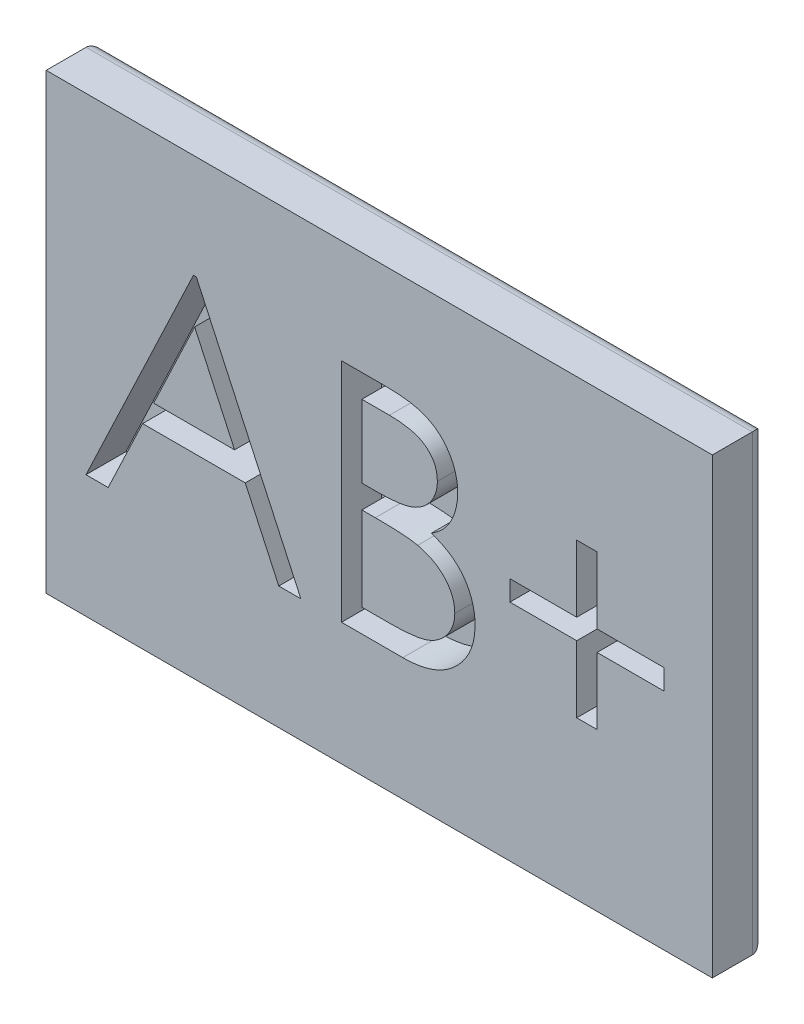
ISO-10303-21;
HEADER;
FILE_DESCRIPTION(('STEP AP214'),'2;1');
FILE_NAME('part.step','',(''),(''),'','','');
FILE_SCHEMA(('AUTOMOTIVE_DESIGN { 1 0 10303 214 1 1 1 1 }'));
ENDSEC;
DATA;
#1=APPLICATION_CONTEXT('core data for automotive mechanical design processes');
#2=APPLICATION_PROTOCOL_DEFINITION('international standard','automotive_design',2000,#1);
#3=PRODUCT_CONTEXT('',#1,'mechanical');
#4=PRODUCT('Part','Part','',(#3));
#5=PRODUCT_RELATED_PRODUCT_CATEGORY('part','',(#4));
#6=PRODUCT_DEFINITION_FORMATION('','',#4);
#7=PRODUCT_DEFINITION_CONTEXT('part definition',#1,'design');
#8=PRODUCT_DEFINITION('design','',#6,#7);
#9=PRODUCT_DEFINITION_SHAPE('','',#8);
#10=(LENGTH_UNIT() NAMED_UNIT(*) SI_UNIT(.MILLI.,.METRE.));
#11=(NAMED_UNIT(*) PLANE_ANGLE_UNIT() SI_UNIT($,.RADIAN.));
#12=(NAMED_UNIT(*) SI_UNIT($,.STERADIAN.) SOLID_ANGLE_UNIT());
#13=UNCERTAINTY_MEASURE_WITH_UNIT(LENGTH_MEASURE(1.E-05),#10,'distance_accuracy_value','');
#14=(GEOMETRIC_REPRESENTATION_CONTEXT(3) GLOBAL_UNCERTAINTY_ASSIGNED_CONTEXT((#13)) GLOBAL_UNIT_ASSIGNED_CONTEXT((#10,
#11,#12)) REPRESENTATION_CONTEXT('',''));
#15=CARTESIAN_POINT('',(0.,0.,0.));
#16=DIRECTION('',(0.,0.,1.));
#17=DIRECTION('',(1.,0.,0.));
#18=AXIS2_PLACEMENT_3D('',#15,#16,#17);
#19=CARTESIAN_POINT('',(0.,0.,2.54));
#20=DIRECTION('',(0.,0.,-1.));
#21=DIRECTION('',(-1.,0.,0.));
#22=AXIS2_PLACEMENT_3D('',#19,#20,#21);
#23=PLANE('',#22);
#24=DIRECTION('',(0.,1.,0.));
#25=VECTOR('',#24,1.);
#26=CARTESIAN_POINT('',(-1.79916666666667,-4.94848719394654,2.54));
#27=LINE('',#26,#25);
#28=CARTESIAN_POINT('',(-1.79916666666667,-4.94848719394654,2.54));
#29=VERTEX_POINT('',#28);
#30=CARTESIAN_POINT('',(-1.79916666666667,5.84651280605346,2.54));
#31=VERTEX_POINT('',#30);
#32=EDGE_CURVE('E64',#29,#31,#27,.T.);
#33=ORIENTED_EDGE('',*,*,#32,.T.);
#34=DIRECTION('',(1.,0.,0.));
#35=VECTOR('',#34,1.);
#36=CARTESIAN_POINT('',(-1.79916666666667,5.84651280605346,2.54));
#37=LINE('',#36,#35);
#38=CARTESIAN_POINT('',(0.307069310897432,5.84651280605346,2.54));
#39=VERTEX_POINT('',#38);
#40=EDGE_CURVE('E866',#31,#39,#37,.T.);
#41=ORIENTED_EDGE('',*,*,#40,.T.);
#42=CARTESIAN_POINT('',(0.307069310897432,5.84651280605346,2.54));
#43=CARTESIAN_POINT('',(0.410172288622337,5.84597074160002,2.54));
#44=CARTESIAN_POINT('',(0.610011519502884,5.84492008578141,2.54));
#45=CARTESIAN_POINT('',(0.900611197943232,5.82862539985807,2.54));
#46=CARTESIAN_POINT('',(1.17279574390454,5.80640722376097,2.54));
#47=CARTESIAN_POINT('',(1.42664409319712,5.77115355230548,2.54));
#48=CARTESIAN_POINT('',(1.66203894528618,5.72861577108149,2.54));
#49=CARTESIAN_POINT('',(1.87968970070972,5.67710259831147,2.54));
#50=CARTESIAN_POINT('',(2.07890424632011,5.61533479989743,2.54));
#51=CARTESIAN_POINT('',(2.31674195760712,5.51711176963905,2.54));
#52=CARTESIAN_POINT('',(2.58791439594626,5.37115359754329,2.54));
#53=CARTESIAN_POINT('',(2.88153343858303,5.15547392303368,2.54));
#54=CARTESIAN_POINT('',(3.13260737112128,4.89166736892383,2.54));
#55=CARTESIAN_POINT('',(3.34908202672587,4.59408729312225,2.54));
#56=CARTESIAN_POINT('',(3.52118862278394,4.2667342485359,2.54));
#57=CARTESIAN_POINT('',(3.64569906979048,3.9174105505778,2.54));
#58=CARTESIAN_POINT('',(3.72452685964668,3.55062192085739,2.54));
#59=CARTESIAN_POINT('',(3.73263370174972,3.29881103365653,2.54));
#60=CARTESIAN_POINT('',(3.73673076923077,3.17154986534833,2.54));
#61=B_SPLINE_CURVE_WITH_KNOTS('',3,(#42,#43,#44,#45,#46,#47,#48,#49,#50,#51,#52,#53,#54,#55,#56,
#57,#58,#59,#60),.UNSPECIFIED.,.F.,.F.,(4,1,1,1,1,1,1,1,1,1,1,1,1,1,1,1,4),(0.,
0.0625940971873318,0.121322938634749,0.176680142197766,0.228365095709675,0.276868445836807,
0.321879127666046,0.364098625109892,0.403355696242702,0.477967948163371,0.550535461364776,
0.623584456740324,0.698174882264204,0.773353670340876,0.847281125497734,0.92281833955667,1.),.UNSPECIFIED.);
#62=CARTESIAN_POINT('',(3.73673076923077,3.17154986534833,2.54));
#63=VERTEX_POINT('',#62);
#64=EDGE_CURVE('E857',#39,#63,#61,.T.);
#65=ORIENTED_EDGE('',*,*,#64,.T.);
#66=CARTESIAN_POINT('',(3.73673076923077,3.17154986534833,2.54));
#67=CARTESIAN_POINT('',(3.73335897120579,3.05233434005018,2.54));
#68=CARTESIAN_POINT('',(3.72673307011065,2.81806459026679,2.54));
#69=CARTESIAN_POINT('',(3.66337333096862,2.47541861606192,2.54));
#70=CARTESIAN_POINT('',(3.56418064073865,2.14925164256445,2.54));
#71=CARTESIAN_POINT('',(3.42629687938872,1.84075402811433,2.54));
#72=CARTESIAN_POINT('',(3.24709372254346,1.55689606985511,2.54));
#73=CARTESIAN_POINT('',(3.03471499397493,1.29538791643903,2.54));
#74=CARTESIAN_POINT('',(2.77848239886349,1.06730172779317,2.54));
#75=CARTESIAN_POINT('',(2.58650646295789,0.939788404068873,2.54));
#76=CARTESIAN_POINT('',(2.48899138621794,0.875017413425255,2.54));
#77=B_SPLINE_CURVE_WITH_KNOTS('',3,(#66,#67,#68,#69,#70,#71,#72,#73,#74,#75,#76),.UNSPECIFIED.,
.F.,.F.,(4,1,1,1,1,1,1,1,4),(0.,0.13056910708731,0.256580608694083,0.380551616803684,
0.503622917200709,0.625739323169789,0.747548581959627,0.871766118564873,1.),.UNSPECIFIED.);
#78=CARTESIAN_POINT('',(2.48899138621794,0.875017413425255,2.54));
#79=VERTEX_POINT('',#78);
#80=EDGE_CURVE('E848',#63,#79,#77,.T.);
#81=ORIENTED_EDGE('',*,*,#80,.T.);
#82=CARTESIAN_POINT('',(2.48899138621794,0.875017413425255,2.54));
#83=CARTESIAN_POINT('',(2.61162390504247,0.827935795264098,2.54));
#84=CARTESIAN_POINT('',(2.84625029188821,0.737856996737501,2.54));
#85=CARTESIAN_POINT('',(3.16913186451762,0.5785984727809,2.54));
#86=CARTESIAN_POINT('',(3.44731853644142,0.405378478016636,2.54));
#87=CARTESIAN_POINT('',(3.68294916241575,0.216213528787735,2.54));
#88=CARTESIAN_POINT('',(3.88446915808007,0.0123150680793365,2.54));
#89=CARTESIAN_POINT('',(4.06043673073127,-0.209306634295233,2.54));
#90=CARTESIAN_POINT('',(4.21058399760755,-0.451542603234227,2.54));
#91=CARTESIAN_POINT('',(4.33923857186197,-0.711867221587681,2.54));
#92=CARTESIAN_POINT('',(4.43962823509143,-0.98762231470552,2.54));
#93=CARTESIAN_POINT('',(4.5148104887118,-1.27622132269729,2.54));
#94=CARTESIAN_POINT('',(4.55789009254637,-1.57662937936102,2.54));
#95=CARTESIAN_POINT('',(4.56402054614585,-1.78107242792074,2.54));
#96=CARTESIAN_POINT('',(4.56711538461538,-1.88428146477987,2.54));
#97=B_SPLINE_CURVE_WITH_KNOTS('',3,(#82,#83,#84,#85,#86,#87,#88,#89,#90,#91,#92,#93,#94,#95,
#96),.UNSPECIFIED.,.F.,.F.,(4,1,1,1,1,1,1,1,1,1,1,1,4),(0.,0.106057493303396,0.20291425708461,
0.290300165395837,0.37022256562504,0.44638372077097,0.521396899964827,0.598291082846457,
0.676142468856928,0.755528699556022,0.834887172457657,0.916646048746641,1.),.UNSPECIFIED.);
#98=CARTESIAN_POINT('',(4.56711538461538,-1.88428146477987,2.54));
#99=VERTEX_POINT('',#98);
#100=EDGE_CURVE('E839',#79,#99,#97,.T.);
#101=ORIENTED_EDGE('',*,*,#100,.T.);
#102=CARTESIAN_POINT('',(4.56711538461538,-1.88428146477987,2.54));
#103=CARTESIAN_POINT('',(4.56410251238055,-1.98966186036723,2.54));
#104=CARTESIAN_POINT('',(4.55817460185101,-2.19700074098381,2.54));
#105=CARTESIAN_POINT('',(4.51443951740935,-2.50158979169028,2.54));
#106=CARTESIAN_POINT('',(4.44038857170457,-2.79266909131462,2.54));
#107=CARTESIAN_POINT('',(4.33838770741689,-3.07212136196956,2.54));
#108=CARTESIAN_POINT('',(4.2052627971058,-3.33940597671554,2.54));
#109=CARTESIAN_POINT('',(4.04325154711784,-3.59482574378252,2.54));
#110=CARTESIAN_POINT('',(3.85007791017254,-3.83581434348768,2.54));
#111=CARTESIAN_POINT('',(3.63398400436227,-4.06504963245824,2.54));
#112=CARTESIAN_POINT('',(3.38951690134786,-4.27116562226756,2.54));
#113=CARTESIAN_POINT('',(3.12576188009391,-4.4547290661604,2.54));
#114=CARTESIAN_POINT('',(2.83939730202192,-4.60569270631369,2.54));
#115=CARTESIAN_POINT('',(2.53512636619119,-4.73250626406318,2.54));
#116=CARTESIAN_POINT('',(2.20953585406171,-4.82937503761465,2.54));
#117=CARTESIAN_POINT('',(1.86408781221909,-4.8971447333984,2.54));
#118=CARTESIAN_POINT('',(1.49908017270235,-4.94280769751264,2.54));
#119=CARTESIAN_POINT('',(1.24860609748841,-4.94656190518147,2.54));
#120=CARTESIAN_POINT('',(1.12015424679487,-4.94848719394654,2.54));
#121=B_SPLINE_CURVE_WITH_KNOTS('',3,(#102,#103,#104,#105,#106,#107,#108,#109,#110,#111,#112,
#113,#114,#115,#116,#117,#118,#119,#120),.UNSPECIFIED.,.F.,.F.,(4,1,1,1,1,1,1,1,1,1,1,1,1,1,1,1,
4),(0.,0.0611602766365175,0.120334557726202,0.178180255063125,0.235235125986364,
0.29268296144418,0.35118624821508,0.410456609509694,0.471719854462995,0.533761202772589,
0.595739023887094,0.657887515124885,0.721295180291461,0.786822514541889,0.854686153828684,
0.925477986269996,1.),.UNSPECIFIED.);
#122=CARTESIAN_POINT('',(1.12015424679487,-4.94848719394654,2.54));
#123=VERTEX_POINT('',#122);
#124=EDGE_CURVE('E833',#99,#123,#121,.T.);
#125=ORIENTED_EDGE('',*,*,#124,.T.);
#126=DIRECTION('',(-1.,0.,0.));
#127=VECTOR('',#126,1.);
#128=CARTESIAN_POINT('',(1.12015424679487,-4.94848719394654,2.54));
#129=LINE('',#128,#127);
#130=EDGE_CURVE('E504',#123,#29,#129,.T.);
#131=ORIENTED_EDGE('',*,*,#130,.T.);
#132=EDGE_LOOP('',(#33,#41,#65,#81,#101,#125,#131));
#133=FACE_BOUND('',#132,.T.);
#134=DIRECTION('',(0.,1.,0.));
#135=VECTOR('',#134,1.);
#136=CARTESIAN_POINT('',(15.875,-10.795,2.54));
#137=LINE('',#136,#135);
#138=CARTESIAN_POINT('',(15.875,-10.795,2.54));
#139=VERTEX_POINT('',#138);
#140=CARTESIAN_POINT('',(15.875,10.795,2.54));
#141=VERTEX_POINT('',#140);
#142=EDGE_CURVE('E632',#139,#141,#137,.T.);
#143=ORIENTED_EDGE('',*,*,#142,.T.);
#144=DIRECTION('',(-1.,0.,0.));
#145=VECTOR('',#144,1.);
#146=CARTESIAN_POINT('',(-15.875,10.795,2.54));
#147=LINE('',#146,#145);
#148=CARTESIAN_POINT('',(-15.875,10.795,2.54));
#149=VERTEX_POINT('',#148);
#150=EDGE_CURVE('E637',#141,#149,#147,.T.);
#151=ORIENTED_EDGE('',*,*,#150,.T.);
#152=DIRECTION('',(0.,-1.,0.));
#153=VECTOR('',#152,1.);
#154=CARTESIAN_POINT('',(-15.875,-10.795,2.54));
#155=LINE('',#154,#153);
#156=CARTESIAN_POINT('',(-15.875,-10.795,2.54));
#157=VERTEX_POINT('',#156);
#158=EDGE_CURVE('E685',#149,#157,#155,.T.);
#159=ORIENTED_EDGE('',*,*,#158,.T.);
#160=DIRECTION('',(1.,0.,0.));
#161=VECTOR('',#160,1.);
#162=CARTESIAN_POINT('',(-15.875,-10.795,2.54));
#163=LINE('',#162,#161);
#164=EDGE_CURVE('E682',#157,#139,#163,.T.);
#165=ORIENTED_EDGE('',*,*,#164,.T.);
#166=EDGE_LOOP('',(#143,#151,#159,#165));
#167=FACE_BOUND('',#166,.T.);
#168=DIRECTION('',(1.,0.,0.));
#169=VECTOR('',#168,1.);
#170=CARTESIAN_POINT('',(-8.8574358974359,5.84651280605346,2.54));
#171=LINE('',#170,#169);
#172=CARTESIAN_POINT('',(-8.85743589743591,5.84651280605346,2.54));
#173=VERTEX_POINT('',#172);
#174=CARTESIAN_POINT('',(-8.71903846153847,5.84651280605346,2.54));
#175=VERTEX_POINT('',#174);
#176=EDGE_CURVE('E747',#173,#175,#171,.T.);
#177=ORIENTED_EDGE('',*,*,#176,.T.);
#178=DIRECTION('',(0.419058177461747,-0.907959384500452,0.));
#179=VECTOR('',#178,1.);
#180=CARTESIAN_POINT('',(-8.71903846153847,5.84651280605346,2.54));
#181=LINE('',#180,#179);
#182=CARTESIAN_POINT('',(-3.73673076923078,-4.94848719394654,2.54));
#183=VERTEX_POINT('',#182);
#184=EDGE_CURVE('E743',#175,#183,#181,.T.);
#185=ORIENTED_EDGE('',*,*,#184,.T.);
#186=DIRECTION('',(-1.,0.,0.));
#187=VECTOR('',#186,1.);
#188=CARTESIAN_POINT('',(-3.73673076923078,-4.94848719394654,2.54));
#189=LINE('',#188,#187);
#190=CARTESIAN_POINT('',(-4.78984875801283,-4.94848719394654,2.54));
#191=VERTEX_POINT('',#190);
#192=EDGE_CURVE('E739',#183,#191,#189,.T.);
#193=ORIENTED_EDGE('',*,*,#192,.T.);
#194=DIRECTION('',(-0.418842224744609,0.908059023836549,0.));
#195=VECTOR('',#194,1.);
#196=CARTESIAN_POINT('',(-4.78984875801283,-4.94848719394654,2.54));
#197=LINE('',#196,#195);
#198=CARTESIAN_POINT('',(-6.38574419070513,-1.48855129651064,2.54));
#199=VERTEX_POINT('',#198);
#200=EDGE_CURVE('E735',#191,#199,#197,.T.);
#201=ORIENTED_EDGE('',*,*,#200,.T.);
#202=DIRECTION('',(-1.,0.,0.));
#203=VECTOR('',#202,1.);
#204=CARTESIAN_POINT('',(-6.38574419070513,-1.48855129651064,2.54));
#205=LINE('',#204,#203);
#206=CARTESIAN_POINT('',(-11.279391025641,-1.48855129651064,2.54));
#207=VERTEX_POINT('',#206);
#208=EDGE_CURVE('E731',#199,#207,#205,.T.);
#209=ORIENTED_EDGE('',*,*,#208,.T.);
#210=DIRECTION('',(-0.428596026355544,-0.903496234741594,0.));
#211=VECTOR('',#210,1.);
#212=CARTESIAN_POINT('',(-11.279391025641,-1.48855129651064,2.54));
#213=LINE('',#212,#211);
#214=CARTESIAN_POINT('',(-12.9206981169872,-4.94848719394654,2.54));
#215=VERTEX_POINT('',#214);
#216=EDGE_CURVE('E727',#207,#215,#213,.T.);
#217=ORIENTED_EDGE('',*,*,#216,.T.);
#218=DIRECTION('',(-1.,0.,0.));
#219=VECTOR('',#218,1.);
#220=CARTESIAN_POINT('',(-12.9206981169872,-4.94848719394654,2.54));
#221=LINE('',#220,#219);
#222=CARTESIAN_POINT('',(-13.978141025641,-4.94848719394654,2.54));
#223=VERTEX_POINT('',#222);
#224=EDGE_CURVE('E723',#215,#223,#221,.T.);
#225=ORIENTED_EDGE('',*,*,#224,.T.);
#226=DIRECTION('',(0.428584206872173,0.903501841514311,0.));
#227=VECTOR('',#226,1.);
#228=CARTESIAN_POINT('',(-13.978141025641,-4.94848719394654,2.54));
#229=LINE('',#228,#227);
#230=EDGE_CURVE('E718',#223,#173,#229,.T.);
#231=ORIENTED_EDGE('',*,*,#230,.T.);
#232=EDGE_LOOP('',(#177,#185,#193,#201,#209,#217,#225,#231));
#233=FACE_BOUND('',#232,.T.);
#234=DIRECTION('',(1.,0.,0.));
#235=VECTOR('',#234,1.);
#236=CARTESIAN_POINT('',(6.22788461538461,0.864205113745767,2.54));
#237=LINE('',#236,#235);
#238=CARTESIAN_POINT('',(6.22788461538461,0.864205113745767,2.54));
#239=VERTEX_POINT('',#238);
#240=CARTESIAN_POINT('',(9.41102564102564,0.864205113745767,2.54));
#241=VERTEX_POINT('',#240);
#242=EDGE_CURVE('E56',#239,#241,#237,.T.);
#243=ORIENTED_EDGE('',*,*,#242,.T.);
#244=DIRECTION('',(0.,1.,0.));
#245=VECTOR('',#244,1.);
#246=CARTESIAN_POINT('',(9.41102564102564,0.864205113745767,2.54));
#247=LINE('',#246,#245);
#248=CARTESIAN_POINT('',(9.41102564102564,4.04734613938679,2.54));
#249=VERTEX_POINT('',#248);
#250=EDGE_CURVE('E363',#241,#249,#247,.T.);
#251=ORIENTED_EDGE('',*,*,#250,.T.);
#252=DIRECTION('',(1.,0.,0.));
#253=VECTOR('',#252,1.);
#254=CARTESIAN_POINT('',(9.41102564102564,4.04734613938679,2.54));
#255=LINE('',#254,#253);
#256=CARTESIAN_POINT('',(10.3798076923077,4.04734613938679,2.54));
#257=VERTEX_POINT('',#256);
#258=EDGE_CURVE('E1125',#249,#257,#255,.T.);
#259=ORIENTED_EDGE('',*,*,#258,.T.);
#260=DIRECTION('',(0.,-1.,0.));
#261=VECTOR('',#260,1.);
#262=CARTESIAN_POINT('',(10.3798076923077,4.04734613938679,2.54));
#263=LINE('',#262,#261);
#264=CARTESIAN_POINT('',(10.3798076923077,0.864205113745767,2.54));
#265=VERTEX_POINT('',#264);
#266=EDGE_CURVE('E1133',#257,#265,#263,.T.);
#267=ORIENTED_EDGE('',*,*,#266,.T.);
#268=DIRECTION('',(1.,0.,0.));
#269=VECTOR('',#268,1.);
#270=CARTESIAN_POINT('',(10.3798076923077,0.864205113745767,2.54));
#271=LINE('',#270,#269);
#272=CARTESIAN_POINT('',(13.5629487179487,0.864205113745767,2.54));
#273=VERTEX_POINT('',#272);
#274=EDGE_CURVE('E1137',#265,#273,#271,.T.);
#275=ORIENTED_EDGE('',*,*,#274,.T.);
#276=DIRECTION('',(0.,-1.,0.));
#277=VECTOR('',#276,1.);
#278=CARTESIAN_POINT('',(13.5629487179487,0.864205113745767,2.54));
#279=LINE('',#278,#277);
#280=CARTESIAN_POINT('',(13.5629487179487,-0.104576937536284,2.54));
#281=VERTEX_POINT('',#280);
#282=EDGE_CURVE('E1141',#273,#281,#279,.T.);
#283=ORIENTED_EDGE('',*,*,#282,.T.);
#284=DIRECTION('',(-1.,0.,0.));
#285=VECTOR('',#284,1.);
#286=CARTESIAN_POINT('',(13.5629487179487,-0.104576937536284,2.54));
#287=LINE('',#286,#285);
#288=CARTESIAN_POINT('',(10.3798076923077,-0.104576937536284,2.54));
#289=VERTEX_POINT('',#288);
#290=EDGE_CURVE('E1145',#281,#289,#287,.T.);
#291=ORIENTED_EDGE('',*,*,#290,.T.);
#292=DIRECTION('',(0.,-1.,0.));
#293=VECTOR('',#292,1.);
#294=CARTESIAN_POINT('',(10.3798076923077,-0.104576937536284,2.54));
#295=LINE('',#294,#293);
#296=CARTESIAN_POINT('',(10.3798076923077,-3.28771796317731,2.54));
#297=VERTEX_POINT('',#296);
#298=EDGE_CURVE('E1149',#289,#297,#295,.T.);
#299=ORIENTED_EDGE('',*,*,#298,.T.);
#300=DIRECTION('',(-1.,0.,0.));
#301=VECTOR('',#300,1.);
#302=CARTESIAN_POINT('',(10.3798076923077,-3.28771796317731,2.54));
#303=LINE('',#302,#301);
#304=CARTESIAN_POINT('',(9.41102564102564,-3.28771796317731,2.54));
#305=VERTEX_POINT('',#304);
#306=EDGE_CURVE('E1153',#297,#305,#303,.T.);
#307=ORIENTED_EDGE('',*,*,#306,.T.);
#308=DIRECTION('',(0.,1.,0.));
#309=VECTOR('',#308,1.);
#310=CARTESIAN_POINT('',(9.41102564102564,-3.28771796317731,2.54));
#311=LINE('',#310,#309);
#312=CARTESIAN_POINT('',(9.41102564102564,-0.104576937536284,2.54));
#313=VERTEX_POINT('',#312);
#314=EDGE_CURVE('E1157',#305,#313,#311,.T.);
#315=ORIENTED_EDGE('',*,*,#314,.T.);
#316=DIRECTION('',(-1.,0.,0.));
#317=VECTOR('',#316,1.);
#318=CARTESIAN_POINT('',(9.41102564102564,-0.104576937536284,2.54));
#319=LINE('',#318,#317);
#320=CARTESIAN_POINT('',(6.22788461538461,-0.104576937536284,2.54));
#321=VERTEX_POINT('',#320);
#322=EDGE_CURVE('E1161',#313,#321,#319,.T.);
#323=ORIENTED_EDGE('',*,*,#322,.T.);
#324=DIRECTION('',(0.,1.,0.));
#325=VECTOR('',#324,1.);
#326=CARTESIAN_POINT('',(6.22788461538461,-0.104576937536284,2.54));
#327=LINE('',#326,#325);
#328=EDGE_CURVE('E359',#321,#239,#327,.T.);
#329=ORIENTED_EDGE('',*,*,#328,.T.);
#330=EDGE_LOOP('',(#243,#251,#259,#267,#275,#283,#291,#299,#307,#315,#323,#329));
#331=FACE_BOUND('',#330,.T.);
#332=ADVANCED_FACE('F38',(#133,#167,#233,#331),#23,.F.);
#333=CARTESIAN_POINT('',(15.875,-10.795,2.54));
#334=DIRECTION('',(-1.,0.,0.));
#335=DIRECTION('',(0.,0.,1.));
#336=AXIS2_PLACEMENT_3D('',#333,#334,#335);
#337=PLANE('',#336);
#338=DIRECTION('',(0.,0.,-1.));
#339=VECTOR('',#338,1.);
#340=CARTESIAN_POINT('',(15.875,-10.795,2.54));
#341=LINE('',#340,#339);
#342=CARTESIAN_POINT('',(15.875,-10.795,0.635));
#343=VERTEX_POINT('',#342);
#344=EDGE_CURVE('E678',#139,#343,#341,.T.);
#345=ORIENTED_EDGE('',*,*,#344,.T.);
#346=DIRECTION('',(0.,1.,0.));
#347=VECTOR('',#346,1.);
#348=CARTESIAN_POINT('',(15.875,10.795,0.635));
#349=LINE('',#348,#347);
#350=CARTESIAN_POINT('',(15.875,10.795,0.635));
#351=VERTEX_POINT('',#350);
#352=EDGE_CURVE('E11',#343,#351,#349,.T.);
#353=ORIENTED_EDGE('',*,*,#352,.T.);
#354=DIRECTION('',(0.,0.,-1.));
#355=VECTOR('',#354,1.);
#356=CARTESIAN_POINT('',(15.875,10.795,2.54));
#357=LINE('',#356,#355);
#358=EDGE_CURVE('E666',#141,#351,#357,.T.);
#359=ORIENTED_EDGE('',*,*,#358,.F.);
#360=ORIENTED_EDGE('',*,*,#142,.F.);
#361=EDGE_LOOP('',(#345,#353,#359,#360));
#362=FACE_BOUND('',#361,.T.);
#363=ADVANCED_FACE('F587',(#362),#337,.F.);
#364=CARTESIAN_POINT('',(-15.875,10.795,2.54));
#365=DIRECTION('',(0.,-1.,0.));
#366=DIRECTION('',(0.,0.,-1.));
#367=AXIS2_PLACEMENT_3D('',#364,#365,#366);
#368=PLANE('',#367);
#369=ORIENTED_EDGE('',*,*,#358,.T.);
#370=DIRECTION('',(-1.,0.,0.));
#371=VECTOR('',#370,1.);
#372=CARTESIAN_POINT('',(-15.875,10.795,0.635));
#373=LINE('',#372,#371);
#374=CARTESIAN_POINT('',(-15.875,10.795,0.635));
#375=VERTEX_POINT('',#374);
#376=EDGE_CURVE('E48',#351,#375,#373,.T.);
#377=ORIENTED_EDGE('',*,*,#376,.T.);
#378=DIRECTION('',(0.,0.,-1.));
#379=VECTOR('',#378,1.);
#380=CARTESIAN_POINT('',(-15.875,10.795,2.54));
#381=LINE('',#380,#379);
#382=EDGE_CURVE('E670',#149,#375,#381,.T.);
#383=ORIENTED_EDGE('',*,*,#382,.F.);
#384=ORIENTED_EDGE('',*,*,#150,.F.);
#385=EDGE_LOOP('',(#369,#377,#383,#384));
#386=FACE_BOUND('',#385,.T.);
#387=ADVANCED_FACE('F601',(#386),#368,.F.);
#388=CARTESIAN_POINT('',(-15.875,-10.795,2.54));
#389=DIRECTION('',(1.,0.,0.));
#390=DIRECTION('',(0.,0.,-1.));
#391=AXIS2_PLACEMENT_3D('',#388,#389,#390);
#392=PLANE('',#391);
#393=ORIENTED_EDGE('',*,*,#382,.T.);
#394=DIRECTION('',(0.,-1.,0.));
#395=VECTOR('',#394,1.);
#396=CARTESIAN_POINT('',(-15.875,-10.795,0.635));
#397=LINE('',#396,#395);
#398=CARTESIAN_POINT('',(-15.875,-10.795,0.635));
#399=VERTEX_POINT('',#398);
#400=EDGE_CURVE('E662',#375,#399,#397,.T.);
#401=ORIENTED_EDGE('',*,*,#400,.T.);
#402=DIRECTION('',(0.,0.,-1.));
#403=VECTOR('',#402,1.);
#404=CARTESIAN_POINT('',(-15.875,-10.795,2.54));
#405=LINE('',#404,#403);
#406=EDGE_CURVE('E674',#157,#399,#405,.T.);
#407=ORIENTED_EDGE('',*,*,#406,.F.);
#408=ORIENTED_EDGE('',*,*,#158,.F.);
#409=EDGE_LOOP('',(#393,#401,#407,#408));
#410=FACE_BOUND('',#409,.T.);
#411=ADVANCED_FACE('F597',(#410),#392,.F.);
#412=CARTESIAN_POINT('',(-15.875,-10.795,2.54));
#413=DIRECTION('',(0.,1.,0.));
#414=DIRECTION('',(0.,0.,1.));
#415=AXIS2_PLACEMENT_3D('',#412,#413,#414);
#416=PLANE('',#415);
#417=ORIENTED_EDGE('',*,*,#406,.T.);
#418=DIRECTION('',(1.,0.,0.));
#419=VECTOR('',#418,1.);
#420=CARTESIAN_POINT('',(15.875,-10.795,0.635));
#421=LINE('',#420,#419);
#422=EDGE_CURVE('E648',#399,#343,#421,.T.);
#423=ORIENTED_EDGE('',*,*,#422,.T.);
#424=ORIENTED_EDGE('',*,*,#344,.F.);
#425=ORIENTED_EDGE('',*,*,#164,.F.);
#426=EDGE_LOOP('',(#417,#423,#424,#425));
#427=FACE_BOUND('',#426,.T.);
#428=ADVANCED_FACE('F593',(#427),#416,.F.);
#429=CARTESIAN_POINT('',(0.,0.,0.));
#430=DIRECTION('',(0.,0.,-1.));
#431=DIRECTION('',(-1.,0.,0.));
#432=AXIS2_PLACEMENT_3D('',#429,#430,#431);
#433=PLANE('',#432);
#434=DIRECTION('',(1.,0.,0.));
#435=VECTOR('',#434,1.);
#436=CARTESIAN_POINT('',(-15.875,-10.16,0.));
#437=LINE('',#436,#435);
#438=CARTESIAN_POINT('',(15.24,-10.16,0.));
#439=VERTEX_POINT('',#438);
#440=CARTESIAN_POINT('',(-15.24,-10.16,0.));
#441=VERTEX_POINT('',#440);
#442=EDGE_CURVE('E654',#439,#441,#437,.F.);
#443=ORIENTED_EDGE('',*,*,#442,.T.);
#444=DIRECTION('',(0.,-1.,0.));
#445=VECTOR('',#444,1.);
#446=CARTESIAN_POINT('',(-15.24,10.795,0.));
#447=LINE('',#446,#445);
#448=CARTESIAN_POINT('',(-15.24,10.16,0.));
#449=VERTEX_POINT('',#448);
#450=EDGE_CURVE('E651',#441,#449,#447,.F.);
#451=ORIENTED_EDGE('',*,*,#450,.T.);
#452=DIRECTION('',(-1.,0.,0.));
#453=VECTOR('',#452,1.);
#454=CARTESIAN_POINT('',(15.875,10.16,0.));
#455=LINE('',#454,#453);
#456=CARTESIAN_POINT('',(15.24,10.16,0.));
#457=VERTEX_POINT('',#456);
#458=EDGE_CURVE('E627',#449,#457,#455,.F.);
#459=ORIENTED_EDGE('',*,*,#458,.T.);
#460=DIRECTION('',(0.,1.,0.));
#461=VECTOR('',#460,1.);
#462=CARTESIAN_POINT('',(15.24,-10.795,0.));
#463=LINE('',#462,#461);
#464=EDGE_CURVE('E659',#457,#439,#463,.F.);
#465=ORIENTED_EDGE('',*,*,#464,.T.);
#466=EDGE_LOOP('',(#443,#451,#459,#465));
#467=FACE_BOUND('',#466,.T.);
#468=ADVANCED_FACE('F590',(#467),#433,.T.);
#469=CARTESIAN_POINT('',(15.24,-10.795,0.635));
#470=DIRECTION('',(0.,-1.,0.));
#471=DIRECTION('',(0.,0.,-1.));
#472=AXIS2_PLACEMENT_3D('',#469,#470,#471);
#473=CYLINDRICAL_SURFACE('',#472,0.635);
#474=CARTESIAN_POINT('',(15.24,-10.16,0.635));
#475=DIRECTION('',(-0.707106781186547,-0.707106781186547,0.));
#476=DIRECTION('',(0.707106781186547,-0.707106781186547,0.));
#477=AXIS2_PLACEMENT_3D('',#474,#475,#476);
#478=ELLIPSE('',#477,0.898025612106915,0.635);
#479=EDGE_CURVE('E633',#439,#343,#478,.T.);
#480=ORIENTED_EDGE('',*,*,#479,.F.);
#481=ORIENTED_EDGE('',*,*,#464,.F.);
#482=CARTESIAN_POINT('',(15.24,10.16,0.635));
#483=DIRECTION('',(0.707106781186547,-0.707106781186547,0.));
#484=DIRECTION('',(-0.707106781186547,-0.707106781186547,0.));
#485=AXIS2_PLACEMENT_3D('',#482,#483,#484);
#486=ELLIPSE('',#485,0.898025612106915,0.635);
#487=EDGE_CURVE('E42',#351,#457,#486,.F.);
#488=ORIENTED_EDGE('',*,*,#487,.F.);
#489=ORIENTED_EDGE('',*,*,#352,.F.);
#490=EDGE_LOOP('',(#480,#481,#488,#489));
#491=FACE_BOUND('',#490,.T.);
#492=ADVANCED_FACE('F40',(#491),#473,.T.);
#493=CARTESIAN_POINT('',(-15.875,10.16,0.635));
#494=DIRECTION('',(1.,0.,0.));
#495=DIRECTION('',(0.,0.,-1.));
#496=AXIS2_PLACEMENT_3D('',#493,#494,#495);
#497=CYLINDRICAL_SURFACE('',#496,0.635);
#498=ORIENTED_EDGE('',*,*,#487,.T.);
#499=ORIENTED_EDGE('',*,*,#458,.F.);
#500=CARTESIAN_POINT('',(-15.24,10.16,0.635));
#501=DIRECTION('',(0.707106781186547,0.707106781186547,0.));
#502=DIRECTION('',(0.707106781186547,-0.707106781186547,0.));
#503=AXIS2_PLACEMENT_3D('',#500,#501,#502);
#504=ELLIPSE('',#503,0.898025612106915,0.635);
#505=EDGE_CURVE('E370',#375,#449,#504,.F.);
#506=ORIENTED_EDGE('',*,*,#505,.F.);
#507=ORIENTED_EDGE('',*,*,#376,.F.);
#508=EDGE_LOOP('',(#498,#499,#506,#507));
#509=FACE_BOUND('',#508,.T.);
#510=ADVANCED_FACE('F614',(#509),#497,.T.);
#511=CARTESIAN_POINT('',(-15.875,-10.16,0.635));
#512=DIRECTION('',(-1.,0.,0.));
#513=DIRECTION('',(0.,0.,1.));
#514=AXIS2_PLACEMENT_3D('',#511,#512,#513);
#515=CYLINDRICAL_SURFACE('',#514,0.635);
#516=ORIENTED_EDGE('',*,*,#479,.T.);
#517=ORIENTED_EDGE('',*,*,#422,.F.);
#518=CARTESIAN_POINT('',(-15.24,-10.16,0.635));
#519=DIRECTION('',(-0.707106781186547,0.707106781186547,0.));
#520=DIRECTION('',(-0.707106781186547,-0.707106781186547,0.));
#521=AXIS2_PLACEMENT_3D('',#518,#519,#520);
#522=ELLIPSE('',#521,0.898025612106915,0.635);
#523=EDGE_CURVE('E365',#441,#399,#522,.T.);
#524=ORIENTED_EDGE('',*,*,#523,.F.);
#525=ORIENTED_EDGE('',*,*,#442,.F.);
#526=EDGE_LOOP('',(#516,#517,#524,#525));
#527=FACE_BOUND('',#526,.T.);
#528=ADVANCED_FACE('F611',(#527),#515,.T.);
#529=CARTESIAN_POINT('',(-15.24,-10.795,0.635));
#530=DIRECTION('',(0.,1.,0.));
#531=DIRECTION('',(0.,0.,1.));
#532=AXIS2_PLACEMENT_3D('',#529,#530,#531);
#533=CYLINDRICAL_SURFACE('',#532,0.635);
#534=ORIENTED_EDGE('',*,*,#505,.T.);
#535=ORIENTED_EDGE('',*,*,#450,.F.);
#536=ORIENTED_EDGE('',*,*,#523,.T.);
#537=ORIENTED_EDGE('',*,*,#400,.F.);
#538=EDGE_LOOP('',(#534,#535,#536,#537));
#539=FACE_BOUND('',#538,.T.);
#540=ADVANCED_FACE('F583',(#539),#533,.T.);
#541=CARTESIAN_POINT('',(-8.8574358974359,5.84651280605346,0.635));
#542=DIRECTION('',(0.,-1.,0.));
#543=DIRECTION('',(0.,0.,-1.));
#544=AXIS2_PLACEMENT_3D('',#541,#542,#543);
#545=PLANE('',#544);
#546=ORIENTED_EDGE('',*,*,#176,.F.);
#547=DIRECTION('',(0.,0.,1.));
#548=VECTOR('',#547,1.);
#549=CARTESIAN_POINT('',(-8.8574358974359,5.84651280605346,0.635));
#550=LINE('',#549,#548);
#551=CARTESIAN_POINT('',(-8.8574358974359,5.84651280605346,0.635));
#552=VERTEX_POINT('',#551);
#553=EDGE_CURVE('E713',#552,#173,#550,.T.);
#554=ORIENTED_EDGE('',*,*,#553,.F.);
#555=DIRECTION('',(1.,0.,0.));
#556=VECTOR('',#555,1.);
#557=CARTESIAN_POINT('',(-8.8574358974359,5.84651280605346,0.635));
#558=LINE('',#557,#556);
#559=CARTESIAN_POINT('',(-8.71903846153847,5.84651280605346,0.635));
#560=VERTEX_POINT('',#559);
#561=EDGE_CURVE('E722',#552,#560,#558,.T.);
#562=ORIENTED_EDGE('',*,*,#561,.T.);
#563=DIRECTION('',(0.,0.,1.));
#564=VECTOR('',#563,1.);
#565=CARTESIAN_POINT('',(-8.71903846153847,5.84651280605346,0.635));
#566=LINE('',#565,#564);
#567=EDGE_CURVE('E690',#560,#175,#566,.T.);
#568=ORIENTED_EDGE('',*,*,#567,.T.);
#569=EDGE_LOOP('',(#546,#554,#562,#568));
#570=FACE_BOUND('',#569,.T.);
#571=ADVANCED_FACE('F579',(#570),#545,.T.);
#572=CARTESIAN_POINT('',(-8.71903846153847,5.84651280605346,0.635));
#573=DIRECTION('',(-0.907959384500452,-0.419058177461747,0.));
#574=DIRECTION('',(0.419058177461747,-0.907959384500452,0.));
#575=AXIS2_PLACEMENT_3D('',#572,#573,#574);
#576=PLANE('',#575);
#577=ORIENTED_EDGE('',*,*,#184,.F.);
#578=ORIENTED_EDGE('',*,*,#567,.F.);
#579=DIRECTION('',(0.419058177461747,-0.907959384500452,0.));
#580=VECTOR('',#579,1.);
#581=CARTESIAN_POINT('',(-8.71903846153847,5.84651280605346,0.635));
#582=LINE('',#581,#580);
#583=CARTESIAN_POINT('',(-3.73673076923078,-4.94848719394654,0.635));
#584=VERTEX_POINT('',#583);
#585=EDGE_CURVE('E769',#560,#584,#582,.T.);
#586=ORIENTED_EDGE('',*,*,#585,.T.);
#587=DIRECTION('',(0.,0.,1.));
#588=VECTOR('',#587,1.);
#589=CARTESIAN_POINT('',(-3.73673076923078,-4.94848719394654,0.635));
#590=LINE('',#589,#588);
#591=EDGE_CURVE('E695',#584,#183,#590,.T.);
#592=ORIENTED_EDGE('',*,*,#591,.T.);
#593=EDGE_LOOP('',(#577,#578,#586,#592));
#594=FACE_BOUND('',#593,.T.);
#595=ADVANCED_FACE('F575',(#594),#576,.T.);
#596=CARTESIAN_POINT('',(-3.73673076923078,-4.94848719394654,0.635));
#597=DIRECTION('',(0.,1.,0.));
#598=DIRECTION('',(0.,0.,1.));
#599=AXIS2_PLACEMENT_3D('',#596,#597,#598);
#600=PLANE('',#599);
#601=ORIENTED_EDGE('',*,*,#192,.F.);
#602=ORIENTED_EDGE('',*,*,#591,.F.);
#603=DIRECTION('',(-1.,0.,0.));
#604=VECTOR('',#603,1.);
#605=CARTESIAN_POINT('',(-3.73673076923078,-4.94848719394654,0.635));
#606=LINE('',#605,#604);
#607=CARTESIAN_POINT('',(-4.78984875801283,-4.94848719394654,0.635));
#608=VERTEX_POINT('',#607);
#609=EDGE_CURVE('E766',#584,#608,#606,.T.);
#610=ORIENTED_EDGE('',*,*,#609,.T.);
#611=DIRECTION('',(0.,0.,1.));
#612=VECTOR('',#611,1.);
#613=CARTESIAN_POINT('',(-4.78984875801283,-4.94848719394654,0.635));
#614=LINE('',#613,#612);
#615=EDGE_CURVE('E698',#608,#191,#614,.T.);
#616=ORIENTED_EDGE('',*,*,#615,.T.);
#617=EDGE_LOOP('',(#601,#602,#610,#616));
#618=FACE_BOUND('',#617,.T.);
#619=ADVANCED_FACE('F571',(#618),#600,.T.);
#620=CARTESIAN_POINT('',(-4.78984875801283,-4.94848719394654,0.635));
#621=DIRECTION('',(0.908059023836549,0.418842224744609,0.));
#622=DIRECTION('',(-0.418842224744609,0.908059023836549,0.));
#623=AXIS2_PLACEMENT_3D('',#620,#621,#622);
#624=PLANE('',#623);
#625=ORIENTED_EDGE('',*,*,#200,.F.);
#626=ORIENTED_EDGE('',*,*,#615,.F.);
#627=DIRECTION('',(-0.418842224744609,0.908059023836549,0.));
#628=VECTOR('',#627,1.);
#629=CARTESIAN_POINT('',(-4.78984875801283,-4.94848719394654,0.635));
#630=LINE('',#629,#628);
#631=CARTESIAN_POINT('',(-6.38574419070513,-1.48855129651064,0.635));
#632=VERTEX_POINT('',#631);
#633=EDGE_CURVE('E763',#608,#632,#630,.T.);
#634=ORIENTED_EDGE('',*,*,#633,.T.);
#635=DIRECTION('',(0.,0.,1.));
#636=VECTOR('',#635,1.);
#637=CARTESIAN_POINT('',(-6.38574419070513,-1.48855129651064,0.635));
#638=LINE('',#637,#636);
#639=EDGE_CURVE('E701',#632,#199,#638,.T.);
#640=ORIENTED_EDGE('',*,*,#639,.T.);
#641=EDGE_LOOP('',(#625,#626,#634,#640));
#642=FACE_BOUND('',#641,.T.);
#643=ADVANCED_FACE('F567',(#642),#624,.T.);
#644=CARTESIAN_POINT('',(-6.38574419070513,-1.48855129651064,0.635));
#645=DIRECTION('',(0.,1.,0.));
#646=DIRECTION('',(0.,0.,1.));
#647=AXIS2_PLACEMENT_3D('',#644,#645,#646);
#648=PLANE('',#647);
#649=ORIENTED_EDGE('',*,*,#208,.F.);
#650=ORIENTED_EDGE('',*,*,#639,.F.);
#651=DIRECTION('',(-1.,0.,0.));
#652=VECTOR('',#651,1.);
#653=CARTESIAN_POINT('',(-6.38574419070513,-1.48855129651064,0.635));
#654=LINE('',#653,#652);
#655=CARTESIAN_POINT('',(-11.279391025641,-1.48855129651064,0.635));
#656=VERTEX_POINT('',#655);
#657=EDGE_CURVE('E760',#632,#656,#654,.T.);
#658=ORIENTED_EDGE('',*,*,#657,.T.);
#659=DIRECTION('',(0.,0.,1.));
#660=VECTOR('',#659,1.);
#661=CARTESIAN_POINT('',(-11.279391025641,-1.48855129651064,0.635));
#662=LINE('',#661,#660);
#663=EDGE_CURVE('E704',#656,#207,#662,.T.);
#664=ORIENTED_EDGE('',*,*,#663,.T.);
#665=EDGE_LOOP('',(#649,#650,#658,#664));
#666=FACE_BOUND('',#665,.T.);
#667=ADVANCED_FACE('F563',(#666),#648,.T.);
#668=CARTESIAN_POINT('',(-11.279391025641,-1.48855129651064,0.635));
#669=DIRECTION('',(-0.903496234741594,0.428596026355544,0.));
#670=DIRECTION('',(-0.428596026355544,-0.903496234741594,0.));
#671=AXIS2_PLACEMENT_3D('',#668,#669,#670);
#672=PLANE('',#671);
#673=ORIENTED_EDGE('',*,*,#216,.F.);
#674=ORIENTED_EDGE('',*,*,#663,.F.);
#675=DIRECTION('',(-0.428596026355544,-0.903496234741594,0.));
#676=VECTOR('',#675,1.);
#677=CARTESIAN_POINT('',(-11.279391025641,-1.48855129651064,0.635));
#678=LINE('',#677,#676);
#679=CARTESIAN_POINT('',(-12.9206981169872,-4.94848719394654,0.635));
#680=VERTEX_POINT('',#679);
#681=EDGE_CURVE('E757',#656,#680,#678,.T.);
#682=ORIENTED_EDGE('',*,*,#681,.T.);
#683=DIRECTION('',(0.,0.,1.));
#684=VECTOR('',#683,1.);
#685=CARTESIAN_POINT('',(-12.9206981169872,-4.94848719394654,0.635));
#686=LINE('',#685,#684);
#687=EDGE_CURVE('E707',#680,#215,#686,.T.);
#688=ORIENTED_EDGE('',*,*,#687,.T.);
#689=EDGE_LOOP('',(#673,#674,#682,#688));
#690=FACE_BOUND('',#689,.T.);
#691=ADVANCED_FACE('F559',(#690),#672,.T.);
#692=CARTESIAN_POINT('',(-12.9206981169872,-4.94848719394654,0.635));
#693=DIRECTION('',(0.,1.,0.));
#694=DIRECTION('',(0.,0.,1.));
#695=AXIS2_PLACEMENT_3D('',#692,#693,#694);
#696=PLANE('',#695);
#697=ORIENTED_EDGE('',*,*,#224,.F.);
#698=ORIENTED_EDGE('',*,*,#687,.F.);
#699=DIRECTION('',(-1.,0.,0.));
#700=VECTOR('',#699,1.);
#701=CARTESIAN_POINT('',(-12.9206981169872,-4.94848719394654,0.635));
#702=LINE('',#701,#700);
#703=CARTESIAN_POINT('',(-13.978141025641,-4.94848719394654,0.635));
#704=VERTEX_POINT('',#703);
#705=EDGE_CURVE('E754',#680,#704,#702,.T.);
#706=ORIENTED_EDGE('',*,*,#705,.T.);
#707=DIRECTION('',(0.,0.,1.));
#708=VECTOR('',#707,1.);
#709=CARTESIAN_POINT('',(-13.978141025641,-4.94848719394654,0.635));
#710=LINE('',#709,#708);
#711=EDGE_CURVE('E710',#704,#223,#710,.T.);
#712=ORIENTED_EDGE('',*,*,#711,.T.);
#713=EDGE_LOOP('',(#697,#698,#706,#712));
#714=FACE_BOUND('',#713,.T.);
#715=ADVANCED_FACE('F555',(#714),#696,.T.);
#716=CARTESIAN_POINT('',(-13.978141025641,-4.94848719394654,0.635));
#717=DIRECTION('',(0.903501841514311,-0.428584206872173,0.));
#718=DIRECTION('',(0.428584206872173,0.903501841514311,0.));
#719=AXIS2_PLACEMENT_3D('',#716,#717,#718);
#720=PLANE('',#719);
#721=ORIENTED_EDGE('',*,*,#230,.F.);
#722=ORIENTED_EDGE('',*,*,#711,.F.);
#723=DIRECTION('',(0.428584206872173,0.903501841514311,0.));
#724=VECTOR('',#723,1.);
#725=CARTESIAN_POINT('',(-13.978141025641,-4.94848719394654,0.635));
#726=LINE('',#725,#724);
#727=EDGE_CURVE('E717',#704,#552,#726,.T.);
#728=ORIENTED_EDGE('',*,*,#727,.T.);
#729=ORIENTED_EDGE('',*,*,#553,.T.);
#730=EDGE_LOOP('',(#721,#722,#728,#729));
#731=FACE_BOUND('',#730,.T.);
#732=ADVANCED_FACE('F551',(#731),#720,.T.);
#733=CARTESIAN_POINT('',(0.,0.,0.634999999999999));
#734=DIRECTION('',(0.,0.,1.));
#735=DIRECTION('',(1.,0.,0.));
#736=AXIS2_PLACEMENT_3D('',#733,#734,#735);
#737=PLANE('',#736);
#738=DIRECTION('',(1.,0.,0.));
#739=VECTOR('',#738,1.);
#740=CARTESIAN_POINT('',(-10.753913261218,-0.381371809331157,0.635));
#741=LINE('',#740,#739);
#742=CARTESIAN_POINT('',(-10.753913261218,-0.381371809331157,0.634999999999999));
#743=VERTEX_POINT('',#742);
#744=CARTESIAN_POINT('',(-6.89608473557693,-0.381371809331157,0.635));
#745=VERTEX_POINT('',#744);
#746=EDGE_CURVE('E779',#743,#745,#741,.T.);
#747=ORIENTED_EDGE('',*,*,#746,.F.);
#748=DIRECTION('',(-0.428351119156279,-0.903612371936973,0.));
#749=VECTOR('',#748,1.);
#750=CARTESIAN_POINT('',(-8.79904947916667,3.74243928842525,0.635));
#751=LINE('',#750,#749);
#752=CARTESIAN_POINT('',(-8.79904947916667,3.74243928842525,0.635));
#753=VERTEX_POINT('',#752);
#754=EDGE_CURVE('E801',#753,#743,#751,.T.);
#755=ORIENTED_EDGE('',*,*,#754,.F.);
#756=DIRECTION('',(-0.418997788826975,0.907987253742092,0.));
#757=VECTOR('',#756,1.);
#758=CARTESIAN_POINT('',(-6.89608473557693,-0.381371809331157,0.635));
#759=LINE('',#758,#757);
#760=EDGE_CURVE('E789',#745,#753,#759,.T.);
#761=ORIENTED_EDGE('',*,*,#760,.F.);
#762=EDGE_LOOP('',(#747,#755,#761));
#763=FACE_BOUND('',#762,.T.);
#764=ORIENTED_EDGE('',*,*,#561,.F.);
#765=ORIENTED_EDGE('',*,*,#727,.F.);
#766=ORIENTED_EDGE('',*,*,#705,.F.);
#767=ORIENTED_EDGE('',*,*,#681,.F.);
#768=ORIENTED_EDGE('',*,*,#657,.F.);
#769=ORIENTED_EDGE('',*,*,#633,.F.);
#770=ORIENTED_EDGE('',*,*,#609,.F.);
#771=ORIENTED_EDGE('',*,*,#585,.F.);
#772=EDGE_LOOP('',(#764,#765,#766,#767,#768,#769,#770,#771));
#773=FACE_BOUND('',#772,.T.);
#774=ADVANCED_FACE('F547',(#763,#773),#737,.T.);
#775=CARTESIAN_POINT('',(-6.89608473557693,-0.381371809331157,0.635));
#776=DIRECTION('',(0.907987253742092,0.418997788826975,0.));
#777=DIRECTION('',(-0.418997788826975,0.907987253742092,0.));
#778=AXIS2_PLACEMENT_3D('',#775,#776,#777);
#779=PLANE('',#778);
#780=DIRECTION('',(-0.418997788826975,0.907987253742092,0.));
#781=VECTOR('',#780,1.);
#782=CARTESIAN_POINT('',(-6.89608473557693,-0.381371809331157,2.54));
#783=LINE('',#782,#781);
#784=CARTESIAN_POINT('',(-6.89608473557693,-0.381371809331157,2.54));
#785=VERTEX_POINT('',#784);
#786=CARTESIAN_POINT('',(-8.79904947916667,3.74243928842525,2.54));
#787=VERTEX_POINT('',#786);
#788=EDGE_CURVE('E794',#785,#787,#783,.T.);
#789=ORIENTED_EDGE('',*,*,#788,.F.);
#790=DIRECTION('',(0.,0.,1.));
#791=VECTOR('',#790,1.);
#792=CARTESIAN_POINT('',(-6.89608473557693,-0.381371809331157,0.635));
#793=LINE('',#792,#791);
#794=EDGE_CURVE('E751',#745,#785,#793,.T.);
#795=ORIENTED_EDGE('',*,*,#794,.F.);
#796=ORIENTED_EDGE('',*,*,#760,.T.);
#797=DIRECTION('',(0.,0.,1.));
#798=VECTOR('',#797,1.);
#799=CARTESIAN_POINT('',(-8.79904947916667,3.74243928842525,0.635));
#800=LINE('',#799,#798);
#801=EDGE_CURVE('E775',#753,#787,#800,.T.);
#802=ORIENTED_EDGE('',*,*,#801,.T.);
#803=EDGE_LOOP('',(#789,#795,#796,#802));
#804=FACE_BOUND('',#803,.T.);
#805=ADVANCED_FACE('F540',(#804),#779,.T.);
#806=CARTESIAN_POINT('',(-10.753913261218,-0.381371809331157,0.635));
#807=DIRECTION('',(0.,-1.,0.));
#808=DIRECTION('',(0.,0.,-1.));
#809=AXIS2_PLACEMENT_3D('',#806,#807,#808);
#810=PLANE('',#809);
#811=DIRECTION('',(1.,0.,0.));
#812=VECTOR('',#811,1.);
#813=CARTESIAN_POINT('',(-10.753913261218,-0.381371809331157,2.54));
#814=LINE('',#813,#812);
#815=CARTESIAN_POINT('',(-10.753913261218,-0.381371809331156,2.54));
#816=VERTEX_POINT('',#815);
#817=EDGE_CURVE('E785',#816,#785,#814,.T.);
#818=ORIENTED_EDGE('',*,*,#817,.F.);
#819=DIRECTION('',(0.,0.,1.));
#820=VECTOR('',#819,1.);
#821=CARTESIAN_POINT('',(-10.753913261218,-0.381371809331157,0.635));
#822=LINE('',#821,#820);
#823=EDGE_CURVE('E778',#743,#816,#822,.T.);
#824=ORIENTED_EDGE('',*,*,#823,.F.);
#825=ORIENTED_EDGE('',*,*,#746,.T.);
#826=ORIENTED_EDGE('',*,*,#794,.T.);
#827=EDGE_LOOP('',(#818,#824,#825,#826));
#828=FACE_BOUND('',#827,.T.);
#829=ADVANCED_FACE('F537',(#828),#810,.T.);
#830=CARTESIAN_POINT('',(-8.79904947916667,3.74243928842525,0.635));
#831=DIRECTION('',(-0.903612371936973,0.428351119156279,0.));
#832=DIRECTION('',(-0.428351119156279,-0.903612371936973,0.));
#833=AXIS2_PLACEMENT_3D('',#830,#831,#832);
#834=PLANE('',#833);
#835=DIRECTION('',(-0.428351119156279,-0.903612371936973,0.));
#836=VECTOR('',#835,1.);
#837=CARTESIAN_POINT('',(-8.79904947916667,3.74243928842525,2.54));
#838=LINE('',#837,#836);
#839=EDGE_CURVE('E790',#787,#816,#838,.T.);
#840=ORIENTED_EDGE('',*,*,#839,.F.);
#841=ORIENTED_EDGE('',*,*,#801,.F.);
#842=ORIENTED_EDGE('',*,*,#754,.T.);
#843=ORIENTED_EDGE('',*,*,#823,.T.);
#844=EDGE_LOOP('',(#840,#841,#842,#843));
#845=FACE_BOUND('',#844,.T.);
#846=ADVANCED_FACE('F536',(#845),#834,.T.);
#847=CARTESIAN_POINT('',(-1.79916666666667,-4.94848719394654,0.635));
#848=DIRECTION('',(1.,0.,0.));
#849=DIRECTION('',(0.,0.,-1.));
#850=AXIS2_PLACEMENT_3D('',#847,#848,#849);
#851=PLANE('',#850);
#852=ORIENTED_EDGE('',*,*,#32,.F.);
#853=DIRECTION('',(0.,0.,1.));
#854=VECTOR('',#853,1.);
#855=CARTESIAN_POINT('',(-1.79916666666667,-4.94848719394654,0.635));
#856=LINE('',#855,#854);
#857=CARTESIAN_POINT('',(-1.79916666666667,-4.94848719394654,0.635));
#858=VERTEX_POINT('',#857);
#859=EDGE_CURVE('E826',#858,#29,#856,.T.);
#860=ORIENTED_EDGE('',*,*,#859,.F.);
#861=DIRECTION('',(0.,1.,0.));
#862=VECTOR('',#861,1.);
#863=CARTESIAN_POINT('',(-1.79916666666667,-4.94848719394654,0.635));
#864=LINE('',#863,#862);
#865=CARTESIAN_POINT('',(-1.79916666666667,5.84651280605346,0.635));
#866=VERTEX_POINT('',#865);
#867=EDGE_CURVE('E499',#858,#866,#864,.T.);
#868=ORIENTED_EDGE('',*,*,#867,.T.);
#869=DIRECTION('',(0.,0.,1.));
#870=VECTOR('',#869,1.);
#871=CARTESIAN_POINT('',(-1.79916666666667,5.84651280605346,0.635));
#872=LINE('',#871,#870);
#873=EDGE_CURVE('E808',#866,#31,#872,.T.);
#874=ORIENTED_EDGE('',*,*,#873,.T.);
#875=EDGE_LOOP('',(#852,#860,#868,#874));
#876=FACE_BOUND('',#875,.T.);
#877=ADVANCED_FACE('F532',(#876),#851,.T.);
#878=CARTESIAN_POINT('',(-1.79916666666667,5.84651280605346,0.635));
#879=DIRECTION('',(0.,-1.,0.));
#880=DIRECTION('',(0.,0.,-1.));
#881=AXIS2_PLACEMENT_3D('',#878,#879,#880);
#882=PLANE('',#881);
#883=ORIENTED_EDGE('',*,*,#40,.F.);
#884=ORIENTED_EDGE('',*,*,#873,.F.);
#885=DIRECTION('',(1.,0.,0.));
#886=VECTOR('',#885,1.);
#887=CARTESIAN_POINT('',(-1.79916666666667,5.84651280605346,0.635));
#888=LINE('',#887,#886);
#889=CARTESIAN_POINT('',(0.307069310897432,5.84651280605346,0.635));
#890=VERTEX_POINT('',#889);
#891=EDGE_CURVE('E503',#866,#890,#888,.T.);
#892=ORIENTED_EDGE('',*,*,#891,.T.);
#893=DIRECTION('',(0.,0.,1.));
#894=VECTOR('',#893,1.);
#895=CARTESIAN_POINT('',(0.307069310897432,5.84651280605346,0.635));
#896=LINE('',#895,#894);
#897=EDGE_CURVE('E811',#890,#39,#896,.T.);
#898=ORIENTED_EDGE('',*,*,#897,.T.);
#899=EDGE_LOOP('',(#883,#884,#892,#898));
#900=FACE_BOUND('',#899,.T.);
#901=ADVANCED_FACE('F527',(#900),#882,.T.);
#902=CARTESIAN_POINT('',(0.307069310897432,5.84651280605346,0.635));
#903=CARTESIAN_POINT('',(0.410172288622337,5.84597074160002,0.635));
#904=CARTESIAN_POINT('',(0.610011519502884,5.84492008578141,0.635000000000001));
#905=CARTESIAN_POINT('',(0.900611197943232,5.82862539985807,0.634999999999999));
#906=CARTESIAN_POINT('',(1.17279574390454,5.80640722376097,0.635));
#907=CARTESIAN_POINT('',(1.42664409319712,5.77115355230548,0.635000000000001));
#908=CARTESIAN_POINT('',(1.66203894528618,5.72861577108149,0.635));
#909=CARTESIAN_POINT('',(1.87968970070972,5.67710259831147,0.635));
#910=CARTESIAN_POINT('',(2.07890424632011,5.61533479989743,0.635));
#911=CARTESIAN_POINT('',(2.31674195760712,5.51711176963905,0.635000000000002));
#912=CARTESIAN_POINT('',(2.58791439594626,5.37115359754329,0.635));
#913=CARTESIAN_POINT('',(2.88153343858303,5.15547392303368,0.635000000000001));
#914=CARTESIAN_POINT('',(3.13260737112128,4.89166736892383,0.635));
#915=CARTESIAN_POINT('',(3.34908202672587,4.59408729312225,0.635));
#916=CARTESIAN_POINT('',(3.52118862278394,4.2667342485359,0.635));
#917=CARTESIAN_POINT('',(3.64569906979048,3.9174105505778,0.635));
#918=CARTESIAN_POINT('',(3.72452685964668,3.55062192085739,0.635));
#919=CARTESIAN_POINT('',(3.73263370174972,3.29881103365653,0.635));
#920=CARTESIAN_POINT('',(3.73673076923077,3.17154986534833,0.635));
#921=B_SPLINE_CURVE_WITH_KNOTS('',3,(#902,#903,#904,#905,#906,#907,#908,#909,#910,#911,#912,
#913,#914,#915,#916,#917,#918,#919,#920),.UNSPECIFIED.,.F.,.F.,(4,1,1,1,1,1,1,1,1,1,1,1,1,1,1,1,
4),(0.,0.0625940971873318,0.121322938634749,0.176680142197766,0.228365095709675,
0.276868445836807,0.321879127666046,0.364098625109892,0.403355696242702,0.477967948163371,
0.550535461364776,0.623584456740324,0.698174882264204,0.773353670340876,0.847281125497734,
0.92281833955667,1.),.UNSPECIFIED.);
#922=DIRECTION('',(0.,0.,1.));
#923=VECTOR('',#922,1.);
#924=SURFACE_OF_LINEAR_EXTRUSION('',#921,#923);
#925=ORIENTED_EDGE('',*,*,#64,.F.);
#926=ORIENTED_EDGE('',*,*,#897,.F.);
#927=CARTESIAN_POINT('',(3.73673076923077,3.17154986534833,0.635));
#928=VERTEX_POINT('',#927);
#929=EDGE_CURVE('E507',#890,#928,#921,.T.);
#930=ORIENTED_EDGE('',*,*,#929,.T.);
#931=DIRECTION('',(0.,0.,1.));
#932=VECTOR('',#931,1.);
#933=CARTESIAN_POINT('',(3.73673076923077,3.17154986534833,0.635));
#934=LINE('',#933,#932);
#935=EDGE_CURVE('E814',#928,#63,#934,.T.);
#936=ORIENTED_EDGE('',*,*,#935,.T.);
#937=EDGE_LOOP('',(#925,#926,#930,#936));
#938=FACE_BOUND('',#937,.T.);
#939=ADVANCED_FACE('F522',(#938),#924,.T.);
#940=CARTESIAN_POINT('',(3.73673076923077,3.17154986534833,0.635));
#941=CARTESIAN_POINT('',(3.73335897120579,3.05233434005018,0.635));
#942=CARTESIAN_POINT('',(3.72673307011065,2.81806459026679,0.635));
#943=CARTESIAN_POINT('',(3.66337333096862,2.47541861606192,0.635));
#944=CARTESIAN_POINT('',(3.56418064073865,2.14925164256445,0.635));
#945=CARTESIAN_POINT('',(3.42629687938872,1.84075402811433,0.635));
#946=CARTESIAN_POINT('',(3.24709372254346,1.55689606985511,0.635000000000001));
#947=CARTESIAN_POINT('',(3.03471499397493,1.29538791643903,0.635));
#948=CARTESIAN_POINT('',(2.77848239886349,1.06730172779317,0.635));
#949=CARTESIAN_POINT('',(2.58650646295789,0.939788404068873,0.635));
#950=CARTESIAN_POINT('',(2.48899138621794,0.875017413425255,0.635));
#951=B_SPLINE_CURVE_WITH_KNOTS('',3,(#940,#941,#942,#943,#944,#945,#946,#947,#948,#949,#950),
.UNSPECIFIED.,.F.,.F.,(4,1,1,1,1,1,1,1,4),(0.,0.13056910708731,0.256580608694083,
0.380551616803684,0.503622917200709,0.625739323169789,0.747548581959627,0.871766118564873,1.),.UNSPECIFIED.);
#952=DIRECTION('',(0.,0.,1.));
#953=VECTOR('',#952,1.);
#954=SURFACE_OF_LINEAR_EXTRUSION('',#951,#953);
#955=ORIENTED_EDGE('',*,*,#80,.F.);
#956=ORIENTED_EDGE('',*,*,#935,.F.);
#957=CARTESIAN_POINT('',(2.48899138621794,0.875017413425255,0.635));
#958=VERTEX_POINT('',#957);
#959=EDGE_CURVE('E513',#928,#958,#951,.T.);
#960=ORIENTED_EDGE('',*,*,#959,.T.);
#961=DIRECTION('',(0.,0.,1.));
#962=VECTOR('',#961,1.);
#963=CARTESIAN_POINT('',(2.48899138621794,0.875017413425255,0.635));
#964=LINE('',#963,#962);
#965=EDGE_CURVE('E817',#958,#79,#964,.T.);
#966=ORIENTED_EDGE('',*,*,#965,.T.);
#967=EDGE_LOOP('',(#955,#956,#960,#966));
#968=FACE_BOUND('',#967,.T.);
#969=ADVANCED_FACE('F526',(#968),#954,.T.);
#970=CARTESIAN_POINT('',(2.48899138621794,0.875017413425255,0.635));
#971=CARTESIAN_POINT('',(2.61162390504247,0.827935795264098,0.635));
#972=CARTESIAN_POINT('',(2.84625029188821,0.737856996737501,0.635));
#973=CARTESIAN_POINT('',(3.16913186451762,0.5785984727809,0.635));
#974=CARTESIAN_POINT('',(3.44731853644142,0.405378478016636,0.635));
#975=CARTESIAN_POINT('',(3.68294916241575,0.216213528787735,0.635));
#976=CARTESIAN_POINT('',(3.88446915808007,0.0123150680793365,0.635000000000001));
#977=CARTESIAN_POINT('',(4.06043673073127,-0.209306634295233,0.634999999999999));
#978=CARTESIAN_POINT('',(4.21058399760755,-0.451542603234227,0.635000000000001));
#979=CARTESIAN_POINT('',(4.33923857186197,-0.711867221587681,0.634999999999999));
#980=CARTESIAN_POINT('',(4.43962823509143,-0.98762231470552,0.635));
#981=CARTESIAN_POINT('',(4.5148104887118,-1.27622132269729,0.635000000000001));
#982=CARTESIAN_POINT('',(4.55789009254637,-1.57662937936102,0.635));
#983=CARTESIAN_POINT('',(4.56402054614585,-1.78107242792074,0.635));
#984=CARTESIAN_POINT('',(4.56711538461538,-1.88428146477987,0.635));
#985=B_SPLINE_CURVE_WITH_KNOTS('',3,(#970,#971,#972,#973,#974,#975,#976,#977,#978,#979,#980,
#981,#982,#983,#984),.UNSPECIFIED.,.F.,.F.,(4,1,1,1,1,1,1,1,1,1,1,1,4),(0.,0.106057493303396,
0.20291425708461,0.290300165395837,0.37022256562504,0.44638372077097,0.521396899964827,
0.598291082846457,0.676142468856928,0.755528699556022,0.834887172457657,0.916646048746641,1.),.UNSPECIFIED.);
#986=DIRECTION('',(0.,0.,1.));
#987=VECTOR('',#986,1.);
#988=SURFACE_OF_LINEAR_EXTRUSION('',#985,#987);
#989=ORIENTED_EDGE('',*,*,#100,.F.);
#990=ORIENTED_EDGE('',*,*,#965,.F.);
#991=CARTESIAN_POINT('',(4.56711538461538,-1.88428146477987,0.635));
#992=VERTEX_POINT('',#991);
#993=EDGE_CURVE('E882',#958,#992,#985,.T.);
#994=ORIENTED_EDGE('',*,*,#993,.T.);
#995=DIRECTION('',(0.,0.,1.));
#996=VECTOR('',#995,1.);
#997=CARTESIAN_POINT('',(4.56711538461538,-1.88428146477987,0.635));
#998=LINE('',#997,#996);
#999=EDGE_CURVE('E820',#992,#99,#998,.T.);
#1000=ORIENTED_EDGE('',*,*,#999,.T.);
#1001=EDGE_LOOP('',(#989,#990,#994,#1000));
#1002=FACE_BOUND('',#1001,.T.);
#1003=ADVANCED_FACE('F894',(#1002),#988,.T.);
#1004=CARTESIAN_POINT('',(4.56711538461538,-1.88428146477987,0.635000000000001));
#1005=CARTESIAN_POINT('',(4.56410251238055,-1.98966186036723,0.635));
#1006=CARTESIAN_POINT('',(4.55817460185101,-2.19700074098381,0.635));
#1007=CARTESIAN_POINT('',(4.51443951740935,-2.50158979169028,0.635000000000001));
#1008=CARTESIAN_POINT('',(4.44038857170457,-2.79266909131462,0.635));
#1009=CARTESIAN_POINT('',(4.33838770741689,-3.07212136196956,0.635));
#1010=CARTESIAN_POINT('',(4.2052627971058,-3.33940597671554,0.635));
#1011=CARTESIAN_POINT('',(4.04325154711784,-3.59482574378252,0.635));
#1012=CARTESIAN_POINT('',(3.85007791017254,-3.83581434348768,0.635));
#1013=CARTESIAN_POINT('',(3.63398400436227,-4.06504963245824,0.635));
#1014=CARTESIAN_POINT('',(3.38951690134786,-4.27116562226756,0.635000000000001));
#1015=CARTESIAN_POINT('',(3.12576188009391,-4.4547290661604,0.635000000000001));
#1016=CARTESIAN_POINT('',(2.83939730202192,-4.60569270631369,0.635));
#1017=CARTESIAN_POINT('',(2.53512636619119,-4.73250626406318,0.634999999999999));
#1018=CARTESIAN_POINT('',(2.20953585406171,-4.82937503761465,0.635000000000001));
#1019=CARTESIAN_POINT('',(1.86408781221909,-4.8971447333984,0.635000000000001));
#1020=CARTESIAN_POINT('',(1.49908017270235,-4.94280769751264,0.635000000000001));
#1021=CARTESIAN_POINT('',(1.24860609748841,-4.94656190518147,0.635));
#1022=CARTESIAN_POINT('',(1.12015424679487,-4.94848719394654,0.635));
#1023=B_SPLINE_CURVE_WITH_KNOTS('',3,(#1004,#1005,#1006,#1007,#1008,#1009,#1010,#1011,#1012,
#1013,#1014,#1015,#1016,#1017,#1018,#1019,#1020,#1021,#1022),.UNSPECIFIED.,.F.,.F.,(4,1,1,1,1,1,
1,1,1,1,1,1,1,1,1,1,4),(0.,0.0611602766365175,0.120334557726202,0.178180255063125,
0.235235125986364,0.29268296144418,0.35118624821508,0.410456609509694,0.471719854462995,
0.533761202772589,0.595739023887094,0.657887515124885,0.721295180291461,0.786822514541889,
0.854686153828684,0.925477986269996,1.),.UNSPECIFIED.);
#1024=DIRECTION('',(0.,0.,1.));
#1025=VECTOR('',#1024,1.);
#1026=SURFACE_OF_LINEAR_EXTRUSION('',#1023,#1025);
#1027=ORIENTED_EDGE('',*,*,#124,.F.);
#1028=ORIENTED_EDGE('',*,*,#999,.F.);
#1029=CARTESIAN_POINT('',(1.12015424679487,-4.94848719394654,0.635));
#1030=VERTEX_POINT('',#1029);
#1031=EDGE_CURVE('E877',#992,#1030,#1023,.T.);
#1032=ORIENTED_EDGE('',*,*,#1031,.T.);
#1033=DIRECTION('',(0.,0.,1.));
#1034=VECTOR('',#1033,1.);
#1035=CARTESIAN_POINT('',(1.12015424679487,-4.94848719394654,0.635));
#1036=LINE('',#1035,#1034);
#1037=EDGE_CURVE('E823',#1030,#123,#1036,.T.);
#1038=ORIENTED_EDGE('',*,*,#1037,.T.);
#1039=EDGE_LOOP('',(#1027,#1028,#1032,#1038));
#1040=FACE_BOUND('',#1039,.T.);
#1041=ADVANCED_FACE('F890',(#1040),#1026,.T.);
#1042=CARTESIAN_POINT('',(1.12015424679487,-4.94848719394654,0.635));
#1043=DIRECTION('',(0.,1.,0.));
#1044=DIRECTION('',(0.,0.,1.));
#1045=AXIS2_PLACEMENT_3D('',#1042,#1043,#1044);
#1046=PLANE('',#1045);
#1047=ORIENTED_EDGE('',*,*,#130,.F.);
#1048=ORIENTED_EDGE('',*,*,#1037,.F.);
#1049=DIRECTION('',(-1.,0.,0.));
#1050=VECTOR('',#1049,1.);
#1051=CARTESIAN_POINT('',(1.12015424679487,-4.94848719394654,0.635));
#1052=LINE('',#1051,#1050);
#1053=EDGE_CURVE('E829',#1030,#858,#1052,.T.);
#1054=ORIENTED_EDGE('',*,*,#1053,.T.);
#1055=ORIENTED_EDGE('',*,*,#859,.T.);
#1056=EDGE_LOOP('',(#1047,#1048,#1054,#1055));
#1057=FACE_BOUND('',#1056,.T.);
#1058=ADVANCED_FACE('F893',(#1057),#1046,.T.);
#1059=CARTESIAN_POINT('',(2.67710234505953,5.30182497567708,0.635000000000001));
#1060=DIRECTION('',(0.,0.,1.));
#1061=DIRECTION('',(0.,-1.,0.));
#1062=AXIS2_PLACEMENT_3D('',#1059,#1060,#1061);
#1063=PLANE('',#1062);
#1064=CARTESIAN_POINT('',(1.83160356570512,0.044632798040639,0.635));
#1065=CARTESIAN_POINT('',(1.77908096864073,0.0552892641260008,0.635));
#1066=CARTESIAN_POINT('',(1.66520114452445,0.078394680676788,0.635));
#1067=CARTESIAN_POINT('',(1.47950376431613,0.102784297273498,0.635));
#1068=CARTESIAN_POINT('',(1.26750270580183,0.124513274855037,0.635000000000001));
#1069=CARTESIAN_POINT('',(1.02870843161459,0.140585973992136,0.635000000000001));
#1070=CARTESIAN_POINT('',(0.762818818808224,0.157199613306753,0.635));
#1071=CARTESIAN_POINT('',(0.469266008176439,0.163660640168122,0.635000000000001));
#1072=CARTESIAN_POINT('',(0.149248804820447,0.17136907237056,0.635));
#1073=CARTESIAN_POINT('',(-0.0727962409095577,0.171927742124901,0.635));
#1074=CARTESIAN_POINT('',(-0.188134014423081,0.172217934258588,0.635000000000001));
#1075=B_SPLINE_CURVE_WITH_KNOTS('',3,(#1064,#1065,#1066,#1067,#1068,#1069,#1070,#1071,#1072,
#1073,#1074),.UNSPECIFIED.,.F.,.F.,(4,1,1,1,1,1,1,1,4),(0.,0.0793064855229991,0.171952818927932,
0.27705650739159,0.394730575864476,0.526177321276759,0.671344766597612,0.829285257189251,1.),.UNSPECIFIED.);
#1076=CARTESIAN_POINT('',(1.83160356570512,0.044632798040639,0.635));
#1077=VERTEX_POINT('',#1076);
#1078=CARTESIAN_POINT('',(-0.188134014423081,0.172217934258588,0.635000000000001));
#1079=VERTEX_POINT('',#1078);
#1080=EDGE_CURVE('E973',#1077,#1079,#1075,.T.);
#1081=ORIENTED_EDGE('',*,*,#1080,.F.);
#1082=CARTESIAN_POINT('',(3.59833333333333,-1.88428146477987,0.635));
#1083=CARTESIAN_POINT('',(3.59748174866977,-1.82724271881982,0.635));
#1084=CARTESIAN_POINT('',(3.59579231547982,-1.71408526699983,0.635000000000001));
#1085=CARTESIAN_POINT('',(3.57031421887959,-1.54779347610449,0.634999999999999));
#1086=CARTESIAN_POINT('',(3.53326001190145,-1.38671396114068,0.635000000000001));
#1087=CARTESIAN_POINT('',(3.48535663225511,-1.23040933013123,0.634999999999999));
#1088=CARTESIAN_POINT('',(3.41559173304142,-1.08170550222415,0.635000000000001));
#1089=CARTESIAN_POINT('',(3.33414640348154,-0.937661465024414,0.634999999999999));
#1090=CARTESIAN_POINT('',(3.23865259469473,-0.798086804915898,0.635));
#1091=CARTESIAN_POINT('',(3.08985380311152,-0.621627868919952,0.634999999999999));
#1092=CARTESIAN_POINT('',(2.87342335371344,-0.418320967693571,0.635));
#1093=CARTESIAN_POINT('',(2.56589917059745,-0.219268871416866,0.635000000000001));
#1094=CARTESIAN_POINT('',(2.21622661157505,-0.0587385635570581,0.635));
#1095=CARTESIAN_POINT('',(1.96261352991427,0.00942253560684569,0.635));
#1096=CARTESIAN_POINT('',(1.83160356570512,0.044632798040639,0.635));
#1097=B_SPLINE_CURVE_WITH_KNOTS('',3,(#1082,#1083,#1084,#1085,#1086,#1087,#1088,#1089,#1090,
#1091,#1092,#1093,#1094,#1095,#1096),.UNSPECIFIED.,.F.,.F.,(4,1,1,1,1,1,1,1,1,1,1,1,4),(0.,
0.0602873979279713,0.119602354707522,0.177503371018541,0.23514266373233,0.292132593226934,
0.350871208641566,0.410097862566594,0.47073152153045,0.594828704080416,0.722578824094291,
0.856691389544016,1.),.UNSPECIFIED.);
#1098=CARTESIAN_POINT('',(3.59833333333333,-1.88428146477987,0.635000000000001));
#1099=VERTEX_POINT('',#1098);
#1100=EDGE_CURVE('E396',#1099,#1077,#1097,.T.);
#1101=ORIENTED_EDGE('',*,*,#1100,.F.);
#1102=CARTESIAN_POINT('',(0.549264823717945,-3.84130770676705,0.635));
#1103=CARTESIAN_POINT('',(0.648020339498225,-3.84012412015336,0.635));
#1104=CARTESIAN_POINT('',(0.83835857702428,-3.8378429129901,0.635));
#1105=CARTESIAN_POINT('',(1.1131722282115,-3.8303957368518,0.635));
#1106=CARTESIAN_POINT('',(1.36788211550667,-3.81345598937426,0.635000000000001));
#1107=CARTESIAN_POINT('',(1.60132595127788,-3.78678971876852,0.635));
#1108=CARTESIAN_POINT('',(1.81602447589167,-3.75786390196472,0.635000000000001));
#1109=CARTESIAN_POINT('',(2.0094021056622,-3.71896710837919,0.635));
#1110=CARTESIAN_POINT('',(2.18302639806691,-3.67440238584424,0.635));
#1111=CARTESIAN_POINT('',(2.38435101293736,-3.60551741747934,0.635000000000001));
#1112=CARTESIAN_POINT('',(2.61105683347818,-3.49850358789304,0.635));
#1113=CARTESIAN_POINT('',(2.85536574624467,-3.33715156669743,0.635));
#1114=CARTESIAN_POINT('',(3.07258032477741,-3.14492867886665,0.635));
#1115=CARTESIAN_POINT('',(3.25703683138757,-2.92245633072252,0.634999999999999));
#1116=CARTESIAN_POINT('',(3.40820689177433,-2.68055170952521,0.635000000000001));
#1117=CARTESIAN_POINT('',(3.51817850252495,-2.42410769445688,0.635));
#1118=CARTESIAN_POINT('',(3.58600458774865,-2.15736161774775,0.635));
#1119=CARTESIAN_POINT('',(3.59421547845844,-1.97549142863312,0.635000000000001));
#1120=CARTESIAN_POINT('',(3.59833333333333,-1.88428146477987,0.635000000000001));
#1121=B_SPLINE_CURVE_WITH_KNOTS('',3,(#1102,#1103,#1104,#1105,#1106,#1107,#1108,#1109,#1110,
#1111,#1112,#1113,#1114,#1115,#1116,#1117,#1118,#1119,#1120),.UNSPECIFIED.,.F.,.F.,(4,1,1,1,1,1,
1,1,1,1,1,1,1,1,1,1,4),(0.,0.0725024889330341,0.139738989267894,0.201795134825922,
0.259821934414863,0.312205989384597,0.360773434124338,0.404540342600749,0.443698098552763,
0.51684079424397,0.587874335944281,0.657965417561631,0.728969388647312,0.799307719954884,
0.866635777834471,0.933116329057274,1.),.UNSPECIFIED.);
#1122=CARTESIAN_POINT('',(0.549264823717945,-3.84130770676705,0.635));
#1123=VERTEX_POINT('',#1122);
#1124=EDGE_CURVE('E389',#1123,#1099,#1121,.T.);
#1125=ORIENTED_EDGE('',*,*,#1124,.F.);
#1126=DIRECTION('',(1.,0.,0.));
#1127=VECTOR('',#1126,1.);
#1128=CARTESIAN_POINT('',(-0.830384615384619,-3.84130770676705,0.635));
#1129=LINE('',#1128,#1127);
#1130=CARTESIAN_POINT('',(-0.830384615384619,-3.84130770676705,0.634999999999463));
#1131=VERTEX_POINT('',#1130);
#1132=EDGE_CURVE('E385',#1131,#1123,#1129,.T.);
#1133=ORIENTED_EDGE('',*,*,#1132,.F.);
#1134=DIRECTION('',(0.,-1.,0.));
#1135=VECTOR('',#1134,1.);
#1136=CARTESIAN_POINT('',(-0.830384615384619,0.172217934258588,0.635));
#1137=LINE('',#1136,#1135);
#1138=CARTESIAN_POINT('',(-0.830384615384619,0.172217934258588,0.635));
#1139=VERTEX_POINT('',#1138);
#1140=EDGE_CURVE('E380',#1139,#1131,#1137,.T.);
#1141=ORIENTED_EDGE('',*,*,#1140,.F.);
#1142=DIRECTION('',(-1.,0.,0.));
#1143=VECTOR('',#1142,1.);
#1144=CARTESIAN_POINT('',(-0.188134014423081,0.172217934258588,0.635));
#1145=LINE('',#1144,#1143);
#1146=EDGE_CURVE('E376',#1079,#1139,#1145,.T.);
#1147=ORIENTED_EDGE('',*,*,#1146,.F.);
#1148=EDGE_LOOP('',(#1081,#1101,#1125,#1133,#1141,#1147));
#1149=FACE_BOUND('',#1148,.T.);
#1150=CARTESIAN_POINT('',(2.76794871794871,3.15208772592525,0.635));
#1151=CARTESIAN_POINT('',(2.7663258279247,3.21200235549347,0.635));
#1152=CARTESIAN_POINT('',(2.7631423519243,3.32953144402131,0.635));
#1153=CARTESIAN_POINT('',(2.7370699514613,3.50086152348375,0.635));
#1154=CARTESIAN_POINT('',(2.69275624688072,3.66199618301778,0.634999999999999));
#1155=CARTESIAN_POINT('',(2.63583793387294,3.81514364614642,0.635000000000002));
#1156=CARTESIAN_POINT('',(2.55629824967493,3.95551519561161,0.634999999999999));
#1157=CARTESIAN_POINT('',(2.46264865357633,4.08796428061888,0.635000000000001));
#1158=CARTESIAN_POINT('',(2.34949950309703,4.20798037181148,0.634999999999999));
#1159=CARTESIAN_POINT('',(2.22070802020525,4.32015429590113,0.635));
#1160=CARTESIAN_POINT('',(2.07263571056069,4.41960563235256,0.635000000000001));
#1161=CARTESIAN_POINT('',(1.90537091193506,4.50670821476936,0.635000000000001));
#1162=CARTESIAN_POINT('',(1.71665063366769,4.5768472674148,0.635));
#1163=CARTESIAN_POINT('',(1.50965541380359,4.63827437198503,0.634999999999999));
#1164=CARTESIAN_POINT('',(1.28119901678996,4.68141826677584,0.635));
#1165=CARTESIAN_POINT('',(1.03391778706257,4.71736064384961,0.635000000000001));
#1166=CARTESIAN_POINT('',(0.765786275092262,4.73565891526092,0.634999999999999));
#1167=CARTESIAN_POINT('',(0.58028159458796,4.7380811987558,0.635000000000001));
#1168=CARTESIAN_POINT('',(0.484391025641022,4.73933331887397,0.635));
#1169=B_SPLINE_CURVE_WITH_KNOTS('',3,(#1150,#1151,#1152,#1153,#1154,#1155,#1156,#1157,#1158,
#1159,#1160,#1161,#1162,#1163,#1164,#1165,#1166,#1167,#1168),.UNSPECIFIED.,.F.,.F.,(4,1,1,1,1,1,
1,1,1,1,1,1,1,1,1,1,4),(0.,0.057003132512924,0.111817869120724,0.164402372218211,
0.215869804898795,0.266841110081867,0.317478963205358,0.369902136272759,0.423400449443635,
0.479718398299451,0.539241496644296,0.602430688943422,0.671029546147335,0.744484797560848,
0.823453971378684,0.908740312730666,1.),.UNSPECIFIED.);
#1170=CARTESIAN_POINT('',(2.76794871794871,3.15208772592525,0.635));
#1171=VERTEX_POINT('',#1170);
#1172=CARTESIAN_POINT('',(0.484391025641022,4.73933331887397,0.635));
#1173=VERTEX_POINT('',#1172);
#1174=EDGE_CURVE('E436',#1171,#1173,#1169,.T.);
#1175=ORIENTED_EDGE('',*,*,#1174,.F.);
#1176=CARTESIAN_POINT('',(-0.179484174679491,1.27939742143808,0.635));
#1177=CARTESIAN_POINT('',(-0.0843376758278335,1.28063089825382,0.635));
#1178=CARTESIAN_POINT('',(0.0995047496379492,1.28301422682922,0.635));
#1179=CARTESIAN_POINT('',(0.36573997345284,1.28984134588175,0.635000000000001));
#1180=CARTESIAN_POINT('',(0.612868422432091,1.30895788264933,0.635));
#1181=CARTESIAN_POINT('',(0.840463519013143,1.32806892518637,0.635));
#1182=CARTESIAN_POINT('',(1.04816685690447,1.35914183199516,0.635));
#1183=CARTESIAN_POINT('',(1.23551828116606,1.39612896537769,0.635));
#1184=CARTESIAN_POINT('',(1.40545809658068,1.43524666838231,0.635000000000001));
#1185=CARTESIAN_POINT('',(1.60143220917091,1.50177312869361,0.635));
#1186=CARTESIAN_POINT('',(1.82372577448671,1.60009298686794,0.635));
#1187=CARTESIAN_POINT('',(2.06070102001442,1.75267826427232,0.635));
#1188=CARTESIAN_POINT('',(2.26961347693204,1.93441780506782,0.635));
#1189=CARTESIAN_POINT('',(2.44602594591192,2.14412135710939,0.635));
#1190=CARTESIAN_POINT('',(2.59040589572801,2.3750300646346,0.635000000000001));
#1191=CARTESIAN_POINT('',(2.69068748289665,2.62345965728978,0.635));
#1192=CARTESIAN_POINT('',(2.75868760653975,2.88321860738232,0.635));
#1193=CARTESIAN_POINT('',(2.76483005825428,3.06154661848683,0.635000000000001));
#1194=CARTESIAN_POINT('',(2.76794871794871,3.15208772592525,0.635));
#1195=B_SPLINE_CURVE_WITH_KNOTS('',3,(#1176,#1177,#1178,#1179,#1180,#1181,#1182,#1183,#1184,
#1185,#1186,#1187,#1188,#1189,#1190,#1191,#1192,#1193,#1194),.UNSPECIFIED.,.F.,.F.,(4,1,1,1,1,1,
1,1,1,1,1,1,1,1,1,1,4),(0.,0.0723010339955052,0.139700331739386,0.202288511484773,
0.260599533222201,0.313190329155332,0.361738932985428,0.405706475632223,0.445539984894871,
0.518831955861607,0.589778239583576,0.658867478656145,0.728430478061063,0.797282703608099,
0.864815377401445,0.931363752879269,1.),.UNSPECIFIED.);
#1196=CARTESIAN_POINT('',(-0.179484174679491,1.27939742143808,0.635));
#1197=VERTEX_POINT('',#1196);
#1198=EDGE_CURVE('E444',#1197,#1171,#1195,.T.);
#1199=ORIENTED_EDGE('',*,*,#1198,.F.);
#1200=DIRECTION('',(1.,0.,0.));
#1201=VECTOR('',#1200,1.);
#1202=CARTESIAN_POINT('',(-0.830384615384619,1.27939742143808,0.635));
#1203=LINE('',#1202,#1201);
#1204=CARTESIAN_POINT('',(-0.830384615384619,1.27939742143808,0.634999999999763));
#1205=VERTEX_POINT('',#1204);
#1206=EDGE_CURVE('E962',#1205,#1197,#1203,.T.);
#1207=ORIENTED_EDGE('',*,*,#1206,.F.);
#1208=DIRECTION('',(0.,-1.,0.));
#1209=VECTOR('',#1208,1.);
#1210=CARTESIAN_POINT('',(-0.830384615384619,4.73933331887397,0.635));
#1211=LINE('',#1210,#1209);
#1212=CARTESIAN_POINT('',(-0.830384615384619,4.73933331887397,0.635));
#1213=VERTEX_POINT('',#1212);
#1214=EDGE_CURVE('E955',#1213,#1205,#1211,.T.);
#1215=ORIENTED_EDGE('',*,*,#1214,.F.);
#1216=DIRECTION('',(-1.,0.,0.));
#1217=VECTOR('',#1216,1.);
#1218=CARTESIAN_POINT('',(0.484391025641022,4.73933331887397,0.635));
#1219=LINE('',#1218,#1217);
#1220=EDGE_CURVE('E480',#1173,#1213,#1219,.T.);
#1221=ORIENTED_EDGE('',*,*,#1220,.F.);
#1222=EDGE_LOOP('',(#1175,#1199,#1207,#1215,#1221));
#1223=FACE_BOUND('',#1222,.T.);
#1224=ORIENTED_EDGE('',*,*,#867,.F.);
#1225=ORIENTED_EDGE('',*,*,#1053,.F.);
#1226=ORIENTED_EDGE('',*,*,#1031,.F.);
#1227=ORIENTED_EDGE('',*,*,#993,.F.);
#1228=ORIENTED_EDGE('',*,*,#959,.F.);
#1229=ORIENTED_EDGE('',*,*,#929,.F.);
#1230=ORIENTED_EDGE('',*,*,#891,.F.);
#1231=EDGE_LOOP('',(#1224,#1225,#1226,#1227,#1228,#1229,#1230));
#1232=FACE_BOUND('',#1231,.T.);
#1233=ADVANCED_FACE('F921',(#1149,#1223,#1232),#1063,.T.);
#1234=CARTESIAN_POINT('',(0.484391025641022,4.73933331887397,0.635));
#1235=DIRECTION('',(0.,1.,0.));
#1236=DIRECTION('',(0.,0.,1.));
#1237=AXIS2_PLACEMENT_3D('',#1234,#1235,#1236);
#1238=PLANE('',#1237);
#1239=DIRECTION('',(-1.,0.,0.));
#1240=VECTOR('',#1239,1.);
#1241=CARTESIAN_POINT('',(0.484391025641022,4.73933331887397,2.54));
#1242=LINE('',#1241,#1240);
#1243=CARTESIAN_POINT('',(0.484391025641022,4.73933331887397,2.54));
#1244=VERTEX_POINT('',#1243);
#1245=CARTESIAN_POINT('',(-0.830384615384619,4.73933331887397,2.53999999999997));
#1246=VERTEX_POINT('',#1245);
#1247=EDGE_CURVE('E449',#1244,#1246,#1242,.T.);
#1248=ORIENTED_EDGE('',*,*,#1247,.F.);
#1249=DIRECTION('',(0.,0.,1.));
#1250=VECTOR('',#1249,1.);
#1251=CARTESIAN_POINT('',(0.484391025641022,4.73933331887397,0.635));
#1252=LINE('',#1251,#1250);
#1253=EDGE_CURVE('E481',#1173,#1244,#1252,.T.);
#1254=ORIENTED_EDGE('',*,*,#1253,.F.);
#1255=ORIENTED_EDGE('',*,*,#1220,.T.);
#1256=DIRECTION('',(0.,0.,1.));
#1257=VECTOR('',#1256,1.);
#1258=CARTESIAN_POINT('',(-0.830384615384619,4.73933331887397,0.635));
#1259=LINE('',#1258,#1257);
#1260=EDGE_CURVE('E443',#1213,#1246,#1259,.T.);
#1261=ORIENTED_EDGE('',*,*,#1260,.T.);
#1262=EDGE_LOOP('',(#1248,#1254,#1255,#1261));
#1263=FACE_BOUND('',#1262,.T.);
#1264=ADVANCED_FACE('F432',(#1263),#1238,.T.);
#1265=DIRECTION('',(0.,0.,1.));
#1266=VECTOR('',#1265,1.);
#1267=SURFACE_OF_LINEAR_EXTRUSION('',#1169,#1266);
#1268=CARTESIAN_POINT('',(2.76794871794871,3.15208772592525,2.54));
#1269=CARTESIAN_POINT('',(2.7663258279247,3.21200235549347,2.54));
#1270=CARTESIAN_POINT('',(2.7631423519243,3.32953144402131,2.54));
#1271=CARTESIAN_POINT('',(2.7370699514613,3.50086152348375,2.54));
#1272=CARTESIAN_POINT('',(2.69275624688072,3.66199618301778,2.54));
#1273=CARTESIAN_POINT('',(2.63583793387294,3.81514364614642,2.54));
#1274=CARTESIAN_POINT('',(2.55629824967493,3.95551519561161,2.54));
#1275=CARTESIAN_POINT('',(2.46264865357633,4.08796428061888,2.54));
#1276=CARTESIAN_POINT('',(2.34949950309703,4.20798037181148,2.54));
#1277=CARTESIAN_POINT('',(2.22070802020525,4.32015429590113,2.54));
#1278=CARTESIAN_POINT('',(2.07263571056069,4.41960563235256,2.54));
#1279=CARTESIAN_POINT('',(1.90537091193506,4.50670821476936,2.54));
#1280=CARTESIAN_POINT('',(1.71665063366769,4.5768472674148,2.54));
#1281=CARTESIAN_POINT('',(1.50965541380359,4.63827437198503,2.54));
#1282=CARTESIAN_POINT('',(1.28119901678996,4.68141826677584,2.54));
#1283=CARTESIAN_POINT('',(1.03391778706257,4.71736064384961,2.54));
#1284=CARTESIAN_POINT('',(0.765786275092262,4.73565891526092,2.54));
#1285=CARTESIAN_POINT('',(0.58028159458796,4.7380811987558,2.54));
#1286=CARTESIAN_POINT('',(0.484391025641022,4.73933331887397,2.54));
#1287=B_SPLINE_CURVE_WITH_KNOTS('',3,(#1268,#1269,#1270,#1271,#1272,#1273,#1274,#1275,#1276,
#1277,#1278,#1279,#1280,#1281,#1282,#1283,#1284,#1285,#1286),.UNSPECIFIED.,.F.,.F.,(4,1,1,1,1,1,
1,1,1,1,1,1,1,1,1,1,4),(0.,0.057003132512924,0.111817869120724,0.164402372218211,
0.215869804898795,0.266841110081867,0.317478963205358,0.369902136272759,0.423400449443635,
0.479718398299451,0.539241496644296,0.602430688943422,0.671029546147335,0.744484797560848,
0.823453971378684,0.908740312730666,1.),.UNSPECIFIED.);
#1288=CARTESIAN_POINT('',(2.76794871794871,3.15208772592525,2.54));
#1289=VERTEX_POINT('',#1288);
#1290=EDGE_CURVE('E471',#1289,#1244,#1287,.T.);
#1291=ORIENTED_EDGE('',*,*,#1290,.F.);
#1292=DIRECTION('',(0.,0.,1.));
#1293=VECTOR('',#1292,1.);
#1294=CARTESIAN_POINT('',(2.76794871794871,3.15208772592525,0.635));
#1295=LINE('',#1294,#1293);
#1296=EDGE_CURVE('E487',#1171,#1289,#1295,.T.);
#1297=ORIENTED_EDGE('',*,*,#1296,.F.);
#1298=ORIENTED_EDGE('',*,*,#1174,.T.);
#1299=ORIENTED_EDGE('',*,*,#1253,.T.);
#1300=EDGE_LOOP('',(#1291,#1297,#1298,#1299));
#1301=FACE_BOUND('',#1300,.T.);
#1302=ADVANCED_FACE('F427',(#1301),#1267,.T.);
#1303=DIRECTION('',(0.,0.,1.));
#1304=VECTOR('',#1303,1.);
#1305=SURFACE_OF_LINEAR_EXTRUSION('',#1195,#1304);
#1306=CARTESIAN_POINT('',(-0.179484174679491,1.27939742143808,2.54));
#1307=CARTESIAN_POINT('',(-0.0843376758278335,1.28063089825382,2.54));
#1308=CARTESIAN_POINT('',(0.0995047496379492,1.28301422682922,2.54));
#1309=CARTESIAN_POINT('',(0.36573997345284,1.28984134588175,2.54));
#1310=CARTESIAN_POINT('',(0.612868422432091,1.30895788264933,2.54));
#1311=CARTESIAN_POINT('',(0.840463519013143,1.32806892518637,2.54));
#1312=CARTESIAN_POINT('',(1.04816685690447,1.35914183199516,2.54));
#1313=CARTESIAN_POINT('',(1.23551828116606,1.39612896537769,2.54));
#1314=CARTESIAN_POINT('',(1.40545809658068,1.43524666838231,2.54));
#1315=CARTESIAN_POINT('',(1.60143220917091,1.50177312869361,2.54));
#1316=CARTESIAN_POINT('',(1.82372577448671,1.60009298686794,2.54));
#1317=CARTESIAN_POINT('',(2.06070102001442,1.75267826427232,2.54));
#1318=CARTESIAN_POINT('',(2.26961347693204,1.93441780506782,2.54));
#1319=CARTESIAN_POINT('',(2.44602594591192,2.14412135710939,2.54));
#1320=CARTESIAN_POINT('',(2.59040589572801,2.3750300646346,2.54));
#1321=CARTESIAN_POINT('',(2.69068748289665,2.62345965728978,2.54));
#1322=CARTESIAN_POINT('',(2.75868760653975,2.88321860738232,2.54));
#1323=CARTESIAN_POINT('',(2.76483005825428,3.06154661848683,2.54));
#1324=CARTESIAN_POINT('',(2.76794871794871,3.15208772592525,2.54));
#1325=B_SPLINE_CURVE_WITH_KNOTS('',3,(#1306,#1307,#1308,#1309,#1310,#1311,#1312,#1313,#1314,
#1315,#1316,#1317,#1318,#1319,#1320,#1321,#1322,#1323,#1324),.UNSPECIFIED.,.F.,.F.,(4,1,1,1,1,1,
1,1,1,1,1,1,1,1,1,1,4),(0.,0.0723010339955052,0.139700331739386,0.202288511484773,
0.260599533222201,0.313190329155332,0.361738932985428,0.405706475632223,0.445539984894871,
0.518831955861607,0.589778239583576,0.658867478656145,0.728430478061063,0.797282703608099,
0.864815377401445,0.931363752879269,1.),.UNSPECIFIED.);
#1326=CARTESIAN_POINT('',(-0.179484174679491,1.27939742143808,2.54));
#1327=VERTEX_POINT('',#1326);
#1328=EDGE_CURVE('E465',#1327,#1289,#1325,.T.);
#1329=ORIENTED_EDGE('',*,*,#1328,.F.);
#1330=DIRECTION('',(0.,0.,1.));
#1331=VECTOR('',#1330,1.);
#1332=CARTESIAN_POINT('',(-0.179484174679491,1.27939742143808,0.635));
#1333=LINE('',#1332,#1331);
#1334=EDGE_CURVE('E490',#1197,#1327,#1333,.T.);
#1335=ORIENTED_EDGE('',*,*,#1334,.F.);
#1336=ORIENTED_EDGE('',*,*,#1198,.T.);
#1337=ORIENTED_EDGE('',*,*,#1296,.T.);
#1338=EDGE_LOOP('',(#1329,#1335,#1336,#1337));
#1339=FACE_BOUND('',#1338,.T.);
#1340=ADVANCED_FACE('F431',(#1339),#1305,.T.);
#1341=CARTESIAN_POINT('',(-0.830384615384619,1.27939742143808,0.635));
#1342=DIRECTION('',(0.,-1.,0.));
#1343=DIRECTION('',(0.,0.,-1.));
#1344=AXIS2_PLACEMENT_3D('',#1341,#1342,#1343);
#1345=PLANE('',#1344);
#1346=DIRECTION('',(1.,0.,0.));
#1347=VECTOR('',#1346,1.);
#1348=CARTESIAN_POINT('',(-0.830384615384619,1.27939742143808,2.54));
#1349=LINE('',#1348,#1347);
#1350=CARTESIAN_POINT('',(-0.830384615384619,1.27939742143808,2.54));
#1351=VERTEX_POINT('',#1350);
#1352=EDGE_CURVE('E461',#1351,#1327,#1349,.T.);
#1353=ORIENTED_EDGE('',*,*,#1352,.F.);
#1354=DIRECTION('',(0.,0.,1.));
#1355=VECTOR('',#1354,1.);
#1356=CARTESIAN_POINT('',(-0.830384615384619,1.27939742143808,0.635));
#1357=LINE('',#1356,#1355);
#1358=EDGE_CURVE('E493',#1205,#1351,#1357,.T.);
#1359=ORIENTED_EDGE('',*,*,#1358,.F.);
#1360=ORIENTED_EDGE('',*,*,#1206,.T.);
#1361=ORIENTED_EDGE('',*,*,#1334,.T.);
#1362=EDGE_LOOP('',(#1353,#1359,#1360,#1361));
#1363=FACE_BOUND('',#1362,.T.);
#1364=ADVANCED_FACE('F940',(#1363),#1345,.T.);
#1365=CARTESIAN_POINT('',(-0.830384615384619,4.73933331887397,0.635));
#1366=DIRECTION('',(-1.,0.,0.));
#1367=DIRECTION('',(0.,0.,1.));
#1368=AXIS2_PLACEMENT_3D('',#1365,#1366,#1367);
#1369=PLANE('',#1368);
#1370=DIRECTION('',(0.,-1.,0.));
#1371=VECTOR('',#1370,1.);
#1372=CARTESIAN_POINT('',(-0.830384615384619,4.73933331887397,2.54));
#1373=LINE('',#1372,#1371);
#1374=EDGE_CURVE('E456',#1246,#1351,#1373,.T.);
#1375=ORIENTED_EDGE('',*,*,#1374,.F.);
#1376=ORIENTED_EDGE('',*,*,#1260,.F.);
#1377=ORIENTED_EDGE('',*,*,#1214,.T.);
#1378=ORIENTED_EDGE('',*,*,#1358,.T.);
#1379=EDGE_LOOP('',(#1375,#1376,#1377,#1378));
#1380=FACE_BOUND('',#1379,.T.);
#1381=ADVANCED_FACE('F425',(#1380),#1369,.T.);
#1382=CARTESIAN_POINT('',(-0.188134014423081,0.172217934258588,0.635));
#1383=DIRECTION('',(0.,1.,0.));
#1384=DIRECTION('',(0.,0.,1.));
#1385=AXIS2_PLACEMENT_3D('',#1382,#1383,#1384);
#1386=PLANE('',#1385);
#1387=DIRECTION('',(-1.,0.,0.));
#1388=VECTOR('',#1387,1.);
#1389=CARTESIAN_POINT('',(-0.188134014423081,0.172217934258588,2.54));
#1390=LINE('',#1389,#1388);
#1391=CARTESIAN_POINT('',(-0.188134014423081,0.172217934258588,2.54));
#1392=VERTEX_POINT('',#1391);
#1393=CARTESIAN_POINT('',(-0.830384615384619,0.172217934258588,2.5399999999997));
#1394=VERTEX_POINT('',#1393);
#1395=EDGE_CURVE('E694',#1392,#1394,#1390,.T.);
#1396=ORIENTED_EDGE('',*,*,#1395,.F.);
#1397=DIRECTION('',(0.,0.,1.));
#1398=VECTOR('',#1397,1.);
#1399=CARTESIAN_POINT('',(-0.188134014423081,0.172217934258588,0.635000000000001));
#1400=LINE('',#1399,#1398);
#1401=EDGE_CURVE('E457',#1079,#1392,#1400,.T.);
#1402=ORIENTED_EDGE('',*,*,#1401,.F.);
#1403=ORIENTED_EDGE('',*,*,#1146,.T.);
#1404=DIRECTION('',(0.,0.,1.));
#1405=VECTOR('',#1404,1.);
#1406=CARTESIAN_POINT('',(-0.830384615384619,0.172217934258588,0.635));
#1407=LINE('',#1406,#1405);
#1408=EDGE_CURVE('E969',#1139,#1394,#1407,.T.);
#1409=ORIENTED_EDGE('',*,*,#1408,.T.);
#1410=EDGE_LOOP('',(#1396,#1402,#1403,#1409));
#1411=FACE_BOUND('',#1410,.T.);
#1412=ADVANCED_FACE('F421',(#1411),#1386,.T.);
#1413=DIRECTION('',(0.,0.,1.));
#1414=VECTOR('',#1413,1.);
#1415=SURFACE_OF_LINEAR_EXTRUSION('',#1075,#1414);
#1416=CARTESIAN_POINT('',(1.83160356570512,0.044632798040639,2.54));
#1417=CARTESIAN_POINT('',(1.77908096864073,0.0552892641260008,2.54));
#1418=CARTESIAN_POINT('',(1.66520114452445,0.078394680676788,2.54));
#1419=CARTESIAN_POINT('',(1.47950376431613,0.102784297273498,2.54));
#1420=CARTESIAN_POINT('',(1.26750270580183,0.124513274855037,2.54));
#1421=CARTESIAN_POINT('',(1.02870843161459,0.140585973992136,2.54));
#1422=CARTESIAN_POINT('',(0.762818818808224,0.157199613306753,2.54));
#1423=CARTESIAN_POINT('',(0.469266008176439,0.163660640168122,2.54));
#1424=CARTESIAN_POINT('',(0.149248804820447,0.17136907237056,2.54));
#1425=CARTESIAN_POINT('',(-0.0727962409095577,0.171927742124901,2.54));
#1426=CARTESIAN_POINT('',(-0.188134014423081,0.172217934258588,2.54));
#1427=B_SPLINE_CURVE_WITH_KNOTS('',3,(#1416,#1417,#1418,#1419,#1420,#1421,#1422,#1423,#1424,
#1425,#1426),.UNSPECIFIED.,.F.,.F.,(4,1,1,1,1,1,1,1,4),(0.,0.0793064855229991,0.171952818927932,
0.27705650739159,0.394730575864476,0.526177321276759,0.671344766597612,0.829285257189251,1.),.UNSPECIFIED.);
#1428=CARTESIAN_POINT('',(1.83160356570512,0.044632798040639,2.54));
#1429=VERTEX_POINT('',#1428);
#1430=EDGE_CURVE('E381',#1429,#1392,#1427,.T.);
#1431=ORIENTED_EDGE('',*,*,#1430,.F.);
#1432=DIRECTION('',(0.,0.,1.));
#1433=VECTOR('',#1432,1.);
#1434=CARTESIAN_POINT('',(1.83160356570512,0.044632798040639,0.635));
#1435=LINE('',#1434,#1433);
#1436=EDGE_CURVE('E983',#1077,#1429,#1435,.T.);
#1437=ORIENTED_EDGE('',*,*,#1436,.F.);
#1438=ORIENTED_EDGE('',*,*,#1080,.T.);
#1439=ORIENTED_EDGE('',*,*,#1401,.T.);
#1440=EDGE_LOOP('',(#1431,#1437,#1438,#1439));
#1441=FACE_BOUND('',#1440,.T.);
#1442=ADVANCED_FACE('F424',(#1441),#1415,.T.);
#1443=DIRECTION('',(0.,0.,1.));
#1444=VECTOR('',#1443,1.);
#1445=SURFACE_OF_LINEAR_EXTRUSION('',#1097,#1444);
#1446=CARTESIAN_POINT('',(3.59833333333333,-1.88428146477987,2.54));
#1447=CARTESIAN_POINT('',(3.59748174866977,-1.82724271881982,2.54));
#1448=CARTESIAN_POINT('',(3.59579231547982,-1.71408526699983,2.54));
#1449=CARTESIAN_POINT('',(3.57031421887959,-1.54779347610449,2.54));
#1450=CARTESIAN_POINT('',(3.53326001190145,-1.38671396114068,2.54));
#1451=CARTESIAN_POINT('',(3.48535663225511,-1.23040933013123,2.54));
#1452=CARTESIAN_POINT('',(3.41559173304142,-1.08170550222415,2.54));
#1453=CARTESIAN_POINT('',(3.33414640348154,-0.937661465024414,2.54));
#1454=CARTESIAN_POINT('',(3.23865259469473,-0.798086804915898,2.54));
#1455=CARTESIAN_POINT('',(3.08985380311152,-0.621627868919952,2.54));
#1456=CARTESIAN_POINT('',(2.87342335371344,-0.418320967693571,2.54));
#1457=CARTESIAN_POINT('',(2.56589917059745,-0.219268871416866,2.54));
#1458=CARTESIAN_POINT('',(2.21622661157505,-0.0587385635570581,2.54));
#1459=CARTESIAN_POINT('',(1.96261352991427,0.00942253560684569,2.54));
#1460=CARTESIAN_POINT('',(1.83160356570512,0.044632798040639,2.54));
#1461=B_SPLINE_CURVE_WITH_KNOTS('',3,(#1446,#1447,#1448,#1449,#1450,#1451,#1452,#1453,#1454,
#1455,#1456,#1457,#1458,#1459,#1460),.UNSPECIFIED.,.F.,.F.,(4,1,1,1,1,1,1,1,1,1,1,1,4),(0.,
0.0602873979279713,0.119602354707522,0.177503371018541,0.23514266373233,0.292132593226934,
0.350871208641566,0.410097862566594,0.47073152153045,0.594828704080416,0.722578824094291,
0.856691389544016,1.),.UNSPECIFIED.);
#1462=CARTESIAN_POINT('',(3.59833333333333,-1.88428146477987,2.54));
#1463=VERTEX_POINT('',#1462);
#1464=EDGE_CURVE('E993',#1463,#1429,#1461,.T.);
#1465=ORIENTED_EDGE('',*,*,#1464,.F.);
#1466=DIRECTION('',(0.,0.,1.));
#1467=VECTOR('',#1466,1.);
#1468=CARTESIAN_POINT('',(3.59833333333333,-1.88428146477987,0.635000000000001));
#1469=LINE('',#1468,#1467);
#1470=EDGE_CURVE('E980',#1099,#1463,#1469,.T.);
#1471=ORIENTED_EDGE('',*,*,#1470,.F.);
#1472=ORIENTED_EDGE('',*,*,#1100,.T.);
#1473=ORIENTED_EDGE('',*,*,#1436,.T.);
#1474=EDGE_LOOP('',(#1465,#1471,#1472,#1473));
#1475=FACE_BOUND('',#1474,.T.);
#1476=ADVANCED_FACE('F410',(#1475),#1445,.T.);
#1477=DIRECTION('',(0.,0.,1.));
#1478=VECTOR('',#1477,1.);
#1479=SURFACE_OF_LINEAR_EXTRUSION('',#1121,#1478);
#1480=CARTESIAN_POINT('',(0.549264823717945,-3.84130770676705,2.54));
#1481=CARTESIAN_POINT('',(0.648020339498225,-3.84012412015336,2.54));
#1482=CARTESIAN_POINT('',(0.83835857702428,-3.8378429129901,2.54));
#1483=CARTESIAN_POINT('',(1.1131722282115,-3.8303957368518,2.54));
#1484=CARTESIAN_POINT('',(1.36788211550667,-3.81345598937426,2.54));
#1485=CARTESIAN_POINT('',(1.60132595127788,-3.78678971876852,2.54));
#1486=CARTESIAN_POINT('',(1.81602447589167,-3.75786390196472,2.54));
#1487=CARTESIAN_POINT('',(2.0094021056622,-3.71896710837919,2.54));
#1488=CARTESIAN_POINT('',(2.18302639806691,-3.67440238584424,2.54));
#1489=CARTESIAN_POINT('',(2.38435101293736,-3.60551741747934,2.54));
#1490=CARTESIAN_POINT('',(2.61105683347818,-3.49850358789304,2.54));
#1491=CARTESIAN_POINT('',(2.85536574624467,-3.33715156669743,2.54));
#1492=CARTESIAN_POINT('',(3.07258032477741,-3.14492867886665,2.54));
#1493=CARTESIAN_POINT('',(3.25703683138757,-2.92245633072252,2.54));
#1494=CARTESIAN_POINT('',(3.40820689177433,-2.68055170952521,2.54));
#1495=CARTESIAN_POINT('',(3.51817850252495,-2.42410769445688,2.54));
#1496=CARTESIAN_POINT('',(3.58600458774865,-2.15736161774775,2.54));
#1497=CARTESIAN_POINT('',(3.59421547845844,-1.97549142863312,2.54));
#1498=CARTESIAN_POINT('',(3.59833333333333,-1.88428146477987,2.54));
#1499=B_SPLINE_CURVE_WITH_KNOTS('',3,(#1480,#1481,#1482,#1483,#1484,#1485,#1486,#1487,#1488,
#1489,#1490,#1491,#1492,#1493,#1494,#1495,#1496,#1497,#1498),.UNSPECIFIED.,.F.,.F.,(4,1,1,1,1,1,
1,1,1,1,1,1,1,1,1,1,4),(0.,0.0725024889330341,0.139738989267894,0.201795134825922,
0.259821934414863,0.312205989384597,0.360773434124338,0.404540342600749,0.443698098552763,
0.51684079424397,0.587874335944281,0.657965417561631,0.728969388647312,0.799307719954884,
0.866635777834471,0.933116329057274,1.),.UNSPECIFIED.);
#1500=CARTESIAN_POINT('',(0.549264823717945,-3.84130770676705,2.54));
#1501=VERTEX_POINT('',#1500);
#1502=EDGE_CURVE('E1002',#1501,#1463,#1499,.T.);
#1503=ORIENTED_EDGE('',*,*,#1502,.F.);
#1504=DIRECTION('',(0.,0.,1.));
#1505=VECTOR('',#1504,1.);
#1506=CARTESIAN_POINT('',(0.549264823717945,-3.84130770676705,0.635));
#1507=LINE('',#1506,#1505);
#1508=EDGE_CURVE('E977',#1123,#1501,#1507,.T.);
#1509=ORIENTED_EDGE('',*,*,#1508,.F.);
#1510=ORIENTED_EDGE('',*,*,#1124,.T.);
#1511=ORIENTED_EDGE('',*,*,#1470,.T.);
#1512=EDGE_LOOP('',(#1503,#1509,#1510,#1511));
#1513=FACE_BOUND('',#1512,.T.);
#1514=ADVANCED_FACE('F405',(#1513),#1479,.T.);
#1515=CARTESIAN_POINT('',(-0.830384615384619,-3.84130770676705,0.635));
#1516=DIRECTION('',(0.,-1.,0.));
#1517=DIRECTION('',(0.,0.,-1.));
#1518=AXIS2_PLACEMENT_3D('',#1515,#1516,#1517);
#1519=PLANE('',#1518);
#1520=DIRECTION('',(1.,0.,0.));
#1521=VECTOR('',#1520,1.);
#1522=CARTESIAN_POINT('',(-0.830384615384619,-3.84130770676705,2.54));
#1523=LINE('',#1522,#1521);
#1524=CARTESIAN_POINT('',(-0.830384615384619,-3.84130770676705,2.54));
#1525=VERTEX_POINT('',#1524);
#1526=EDGE_CURVE('E1011',#1525,#1501,#1523,.T.);
#1527=ORIENTED_EDGE('',*,*,#1526,.F.);
#1528=DIRECTION('',(0.,0.,1.));
#1529=VECTOR('',#1528,1.);
#1530=CARTESIAN_POINT('',(-0.830384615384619,-3.84130770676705,0.635));
#1531=LINE('',#1530,#1529);
#1532=EDGE_CURVE('E972',#1131,#1525,#1531,.T.);
#1533=ORIENTED_EDGE('',*,*,#1532,.F.);
#1534=ORIENTED_EDGE('',*,*,#1132,.T.);
#1535=ORIENTED_EDGE('',*,*,#1508,.T.);
#1536=EDGE_LOOP('',(#1527,#1533,#1534,#1535));
#1537=FACE_BOUND('',#1536,.T.);
#1538=ADVANCED_FACE('F409',(#1537),#1519,.T.);
#1539=CARTESIAN_POINT('',(-0.830384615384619,0.172217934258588,0.635));
#1540=DIRECTION('',(-1.,0.,0.));
#1541=DIRECTION('',(0.,0.,1.));
#1542=AXIS2_PLACEMENT_3D('',#1539,#1540,#1541);
#1543=PLANE('',#1542);
#1544=DIRECTION('',(0.,-1.,0.));
#1545=VECTOR('',#1544,1.);
#1546=CARTESIAN_POINT('',(-0.830384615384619,0.172217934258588,2.54));
#1547=LINE('',#1546,#1545);
#1548=EDGE_CURVE('E1018',#1394,#1525,#1547,.T.);
#1549=ORIENTED_EDGE('',*,*,#1548,.F.);
#1550=ORIENTED_EDGE('',*,*,#1408,.F.);
#1551=ORIENTED_EDGE('',*,*,#1140,.T.);
#1552=ORIENTED_EDGE('',*,*,#1532,.T.);
#1553=EDGE_LOOP('',(#1549,#1550,#1551,#1552));
#1554=FACE_BOUND('',#1553,.T.);
#1555=ADVANCED_FACE('F415',(#1554),#1543,.T.);
#1556=ORIENTED_EDGE('',*,*,#1247,.T.);
#1557=ORIENTED_EDGE('',*,*,#1374,.T.);
#1558=ORIENTED_EDGE('',*,*,#1352,.T.);
#1559=ORIENTED_EDGE('',*,*,#1328,.T.);
#1560=ORIENTED_EDGE('',*,*,#1290,.T.);
#1561=EDGE_LOOP('',(#1556,#1557,#1558,#1559,#1560));
#1562=FACE_BOUND('',#1561,.T.);
#1563=ADVANCED_FACE('F419',(#1562),#23,.F.);
#1564=CARTESIAN_POINT('',(6.22788461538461,0.864205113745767,0.635));
#1565=DIRECTION('',(0.,-1.,0.));
#1566=DIRECTION('',(0.,0.,-1.));
#1567=AXIS2_PLACEMENT_3D('',#1564,#1565,#1566);
#1568=PLANE('',#1567);
#1569=ORIENTED_EDGE('',*,*,#242,.F.);
#1570=DIRECTION('',(0.,0.,1.));
#1571=VECTOR('',#1570,1.);
#1572=CARTESIAN_POINT('',(6.22788461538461,0.864205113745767,0.635));
#1573=LINE('',#1572,#1571);
#1574=CARTESIAN_POINT('',(6.22788461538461,0.864205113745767,0.635));
#1575=VERTEX_POINT('',#1574);
#1576=EDGE_CURVE('E357',#1575,#239,#1573,.T.);
#1577=ORIENTED_EDGE('',*,*,#1576,.F.);
#1578=DIRECTION('',(1.,0.,0.));
#1579=VECTOR('',#1578,1.);
#1580=CARTESIAN_POINT('',(6.22788461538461,0.864205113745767,0.635));
#1581=LINE('',#1580,#1579);
#1582=CARTESIAN_POINT('',(9.41102564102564,0.864205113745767,0.635));
#1583=VERTEX_POINT('',#1582);
#1584=EDGE_CURVE('E347',#1575,#1583,#1581,.T.);
#1585=ORIENTED_EDGE('',*,*,#1584,.T.);
#1586=DIRECTION('',(0.,0.,1.));
#1587=VECTOR('',#1586,1.);
#1588=CARTESIAN_POINT('',(9.41102564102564,0.864205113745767,0.635));
#1589=LINE('',#1588,#1587);
#1590=EDGE_CURVE('E356',#1583,#241,#1589,.T.);
#1591=ORIENTED_EDGE('',*,*,#1590,.T.);
#1592=EDGE_LOOP('',(#1569,#1577,#1585,#1591));
#1593=FACE_BOUND('',#1592,.T.);
#1594=ADVANCED_FACE('F355',(#1593),#1568,.T.);
#1595=CARTESIAN_POINT('',(9.41102564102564,0.864205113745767,0.635));
#1596=DIRECTION('',(1.,0.,0.));
#1597=DIRECTION('',(0.,0.,-1.));
#1598=AXIS2_PLACEMENT_3D('',#1595,#1596,#1597);
#1599=PLANE('',#1598);
#1600=ORIENTED_EDGE('',*,*,#250,.F.);
#1601=ORIENTED_EDGE('',*,*,#1590,.F.);
#1602=DIRECTION('',(0.,1.,0.));
#1603=VECTOR('',#1602,1.);
#1604=CARTESIAN_POINT('',(9.41102564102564,0.864205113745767,0.635));
#1605=LINE('',#1604,#1603);
#1606=CARTESIAN_POINT('',(9.41102564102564,4.04734613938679,0.635));
#1607=VERTEX_POINT('',#1606);
#1608=EDGE_CURVE('E343',#1583,#1607,#1605,.T.);
#1609=ORIENTED_EDGE('',*,*,#1608,.T.);
#1610=DIRECTION('',(0.,0.,1.));
#1611=VECTOR('',#1610,1.);
#1612=CARTESIAN_POINT('',(9.41102564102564,4.04734613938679,0.635));
#1613=LINE('',#1612,#1611);
#1614=EDGE_CURVE('E366',#1607,#249,#1613,.T.);
#1615=ORIENTED_EDGE('',*,*,#1614,.T.);
#1616=EDGE_LOOP('',(#1600,#1601,#1609,#1615));
#1617=FACE_BOUND('',#1616,.T.);
#1618=ADVANCED_FACE('F361',(#1617),#1599,.T.);
#1619=CARTESIAN_POINT('',(9.41102564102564,4.04734613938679,0.635));
#1620=DIRECTION('',(0.,-1.,0.));
#1621=DIRECTION('',(0.,0.,-1.));
#1622=AXIS2_PLACEMENT_3D('',#1619,#1620,#1621);
#1623=PLANE('',#1622);
#1624=ORIENTED_EDGE('',*,*,#258,.F.);
#1625=ORIENTED_EDGE('',*,*,#1614,.F.);
#1626=DIRECTION('',(1.,0.,0.));
#1627=VECTOR('',#1626,1.);
#1628=CARTESIAN_POINT('',(9.41102564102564,4.04734613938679,0.635));
#1629=LINE('',#1628,#1627);
#1630=CARTESIAN_POINT('',(10.3798076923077,4.04734613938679,0.635));
#1631=VERTEX_POINT('',#1630);
#1632=EDGE_CURVE('E349',#1607,#1631,#1629,.T.);
#1633=ORIENTED_EDGE('',*,*,#1632,.T.);
#1634=DIRECTION('',(0.,0.,1.));
#1635=VECTOR('',#1634,1.);
#1636=CARTESIAN_POINT('',(10.3798076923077,4.04734613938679,0.635));
#1637=LINE('',#1636,#1635);
#1638=EDGE_CURVE('E372',#1631,#257,#1637,.T.);
#1639=ORIENTED_EDGE('',*,*,#1638,.T.);
#1640=EDGE_LOOP('',(#1624,#1625,#1633,#1639));
#1641=FACE_BOUND('',#1640,.T.);
#1642=ADVANCED_FACE('F1039',(#1641),#1623,.T.);
#1643=CARTESIAN_POINT('',(10.3798076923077,4.04734613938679,0.635));
#1644=DIRECTION('',(-1.,0.,0.));
#1645=DIRECTION('',(0.,0.,1.));
#1646=AXIS2_PLACEMENT_3D('',#1643,#1644,#1645);
#1647=PLANE('',#1646);
#1648=ORIENTED_EDGE('',*,*,#266,.F.);
#1649=ORIENTED_EDGE('',*,*,#1638,.F.);
#1650=DIRECTION('',(0.,-1.,0.));
#1651=VECTOR('',#1650,1.);
#1652=CARTESIAN_POINT('',(10.3798076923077,4.04734613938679,0.635));
#1653=LINE('',#1652,#1651);
#1654=CARTESIAN_POINT('',(10.3798076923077,0.864205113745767,0.635));
#1655=VERTEX_POINT('',#1654);
#1656=EDGE_CURVE('E1239',#1631,#1655,#1653,.T.);
#1657=ORIENTED_EDGE('',*,*,#1656,.T.);
#1658=DIRECTION('',(0.,0.,1.));
#1659=VECTOR('',#1658,1.);
#1660=CARTESIAN_POINT('',(10.3798076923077,0.864205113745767,0.635));
#1661=LINE('',#1660,#1659);
#1662=EDGE_CURVE('E1189',#1655,#265,#1661,.T.);
#1663=ORIENTED_EDGE('',*,*,#1662,.T.);
#1664=EDGE_LOOP('',(#1648,#1649,#1657,#1663));
#1665=FACE_BOUND('',#1664,.T.);
#1666=ADVANCED_FACE('F1042',(#1665),#1647,.T.);
#1667=CARTESIAN_POINT('',(10.3798076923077,0.864205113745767,0.635));
#1668=DIRECTION('',(0.,-1.,0.));
#1669=DIRECTION('',(0.,0.,-1.));
#1670=AXIS2_PLACEMENT_3D('',#1667,#1668,#1669);
#1671=PLANE('',#1670);
#1672=ORIENTED_EDGE('',*,*,#274,.F.);
#1673=ORIENTED_EDGE('',*,*,#1662,.F.);
#1674=DIRECTION('',(1.,0.,0.));
#1675=VECTOR('',#1674,1.);
#1676=CARTESIAN_POINT('',(10.3798076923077,0.864205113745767,0.635));
#1677=LINE('',#1676,#1675);
#1678=CARTESIAN_POINT('',(13.5629487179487,0.864205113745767,0.635));
#1679=VERTEX_POINT('',#1678);
#1680=EDGE_CURVE('E1200',#1655,#1679,#1677,.T.);
#1681=ORIENTED_EDGE('',*,*,#1680,.T.);
#1682=DIRECTION('',(0.,0.,1.));
#1683=VECTOR('',#1682,1.);
#1684=CARTESIAN_POINT('',(13.5629487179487,0.864205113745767,0.635));
#1685=LINE('',#1684,#1683);
#1686=EDGE_CURVE('E1186',#1679,#273,#1685,.T.);
#1687=ORIENTED_EDGE('',*,*,#1686,.T.);
#1688=EDGE_LOOP('',(#1672,#1673,#1681,#1687));
#1689=FACE_BOUND('',#1688,.T.);
#1690=ADVANCED_FACE('F1046',(#1689),#1671,.T.);
#1691=CARTESIAN_POINT('',(13.5629487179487,0.864205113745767,0.635));
#1692=DIRECTION('',(-1.,0.,0.));
#1693=DIRECTION('',(0.,0.,1.));
#1694=AXIS2_PLACEMENT_3D('',#1691,#1692,#1693);
#1695=PLANE('',#1694);
#1696=ORIENTED_EDGE('',*,*,#282,.F.);
#1697=ORIENTED_EDGE('',*,*,#1686,.F.);
#1698=DIRECTION('',(0.,-1.,0.));
#1699=VECTOR('',#1698,1.);
#1700=CARTESIAN_POINT('',(13.5629487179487,0.864205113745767,0.635));
#1701=LINE('',#1700,#1699);
#1702=CARTESIAN_POINT('',(13.5629487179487,-0.104576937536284,0.635));
#1703=VERTEX_POINT('',#1702);
#1704=EDGE_CURVE('E1204',#1679,#1703,#1701,.T.);
#1705=ORIENTED_EDGE('',*,*,#1704,.T.);
#1706=DIRECTION('',(0.,0.,1.));
#1707=VECTOR('',#1706,1.);
#1708=CARTESIAN_POINT('',(13.5629487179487,-0.104576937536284,0.635));
#1709=LINE('',#1708,#1707);
#1710=EDGE_CURVE('E1183',#1703,#281,#1709,.T.);
#1711=ORIENTED_EDGE('',*,*,#1710,.T.);
#1712=EDGE_LOOP('',(#1696,#1697,#1705,#1711));
#1713=FACE_BOUND('',#1712,.T.);
#1714=ADVANCED_FACE('F1050',(#1713),#1695,.T.);
#1715=CARTESIAN_POINT('',(13.5629487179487,-0.104576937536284,0.635));
#1716=DIRECTION('',(0.,1.,0.));
#1717=DIRECTION('',(0.,0.,1.));
#1718=AXIS2_PLACEMENT_3D('',#1715,#1716,#1717);
#1719=PLANE('',#1718);
#1720=ORIENTED_EDGE('',*,*,#290,.F.);
#1721=ORIENTED_EDGE('',*,*,#1710,.F.);
#1722=DIRECTION('',(-1.,0.,0.));
#1723=VECTOR('',#1722,1.);
#1724=CARTESIAN_POINT('',(13.5629487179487,-0.104576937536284,0.635));
#1725=LINE('',#1724,#1723);
#1726=CARTESIAN_POINT('',(10.3798076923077,-0.104576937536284,0.635));
#1727=VERTEX_POINT('',#1726);
#1728=EDGE_CURVE('E1232',#1703,#1727,#1725,.T.);
#1729=ORIENTED_EDGE('',*,*,#1728,.T.);
#1730=DIRECTION('',(0.,0.,1.));
#1731=VECTOR('',#1730,1.);
#1732=CARTESIAN_POINT('',(10.3798076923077,-0.104576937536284,0.635));
#1733=LINE('',#1732,#1731);
#1734=EDGE_CURVE('E1180',#1727,#289,#1733,.T.);
#1735=ORIENTED_EDGE('',*,*,#1734,.T.);
#1736=EDGE_LOOP('',(#1720,#1721,#1729,#1735));
#1737=FACE_BOUND('',#1736,.T.);
#1738=ADVANCED_FACE('F1054',(#1737),#1719,.T.);
#1739=CARTESIAN_POINT('',(10.3798076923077,-0.104576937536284,0.635));
#1740=DIRECTION('',(-1.,0.,0.));
#1741=DIRECTION('',(0.,0.,1.));
#1742=AXIS2_PLACEMENT_3D('',#1739,#1740,#1741);
#1743=PLANE('',#1742);
#1744=ORIENTED_EDGE('',*,*,#298,.F.);
#1745=ORIENTED_EDGE('',*,*,#1734,.F.);
#1746=DIRECTION('',(0.,-1.,0.));
#1747=VECTOR('',#1746,1.);
#1748=CARTESIAN_POINT('',(10.3798076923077,-0.104576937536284,0.635));
#1749=LINE('',#1748,#1747);
#1750=CARTESIAN_POINT('',(10.3798076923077,-3.28771796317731,0.635));
#1751=VERTEX_POINT('',#1750);
#1752=EDGE_CURVE('E1211',#1727,#1751,#1749,.T.);
#1753=ORIENTED_EDGE('',*,*,#1752,.T.);
#1754=DIRECTION('',(0.,0.,1.));
#1755=VECTOR('',#1754,1.);
#1756=CARTESIAN_POINT('',(10.3798076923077,-3.28771796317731,0.635));
#1757=LINE('',#1756,#1755);
#1758=EDGE_CURVE('E1177',#1751,#297,#1757,.T.);
#1759=ORIENTED_EDGE('',*,*,#1758,.T.);
#1760=EDGE_LOOP('',(#1744,#1745,#1753,#1759));
#1761=FACE_BOUND('',#1760,.T.);
#1762=ADVANCED_FACE('F1058',(#1761),#1743,.T.);
#1763=CARTESIAN_POINT('',(10.3798076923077,-3.28771796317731,0.635));
#1764=DIRECTION('',(0.,1.,0.));
#1765=DIRECTION('',(0.,0.,1.));
#1766=AXIS2_PLACEMENT_3D('',#1763,#1764,#1765);
#1767=PLANE('',#1766);
#1768=ORIENTED_EDGE('',*,*,#306,.F.);
#1769=ORIENTED_EDGE('',*,*,#1758,.F.);
#1770=DIRECTION('',(-1.,0.,0.));
#1771=VECTOR('',#1770,1.);
#1772=CARTESIAN_POINT('',(10.3798076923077,-3.28771796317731,0.635));
#1773=LINE('',#1772,#1771);
#1774=CARTESIAN_POINT('',(9.41102564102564,-3.28771796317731,0.635));
#1775=VERTEX_POINT('',#1774);
#1776=EDGE_CURVE('E1215',#1751,#1775,#1773,.T.);
#1777=ORIENTED_EDGE('',*,*,#1776,.T.);
#1778=DIRECTION('',(0.,0.,1.));
#1779=VECTOR('',#1778,1.);
#1780=CARTESIAN_POINT('',(9.41102564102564,-3.28771796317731,0.635));
#1781=LINE('',#1780,#1779);
#1782=EDGE_CURVE('E1174',#1775,#305,#1781,.T.);
#1783=ORIENTED_EDGE('',*,*,#1782,.T.);
#1784=EDGE_LOOP('',(#1768,#1769,#1777,#1783));
#1785=FACE_BOUND('',#1784,.T.);
#1786=ADVANCED_FACE('F1062',(#1785),#1767,.T.);
#1787=CARTESIAN_POINT('',(9.41102564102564,-3.28771796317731,0.635));
#1788=DIRECTION('',(1.,0.,0.));
#1789=DIRECTION('',(0.,0.,-1.));
#1790=AXIS2_PLACEMENT_3D('',#1787,#1788,#1789);
#1791=PLANE('',#1790);
#1792=ORIENTED_EDGE('',*,*,#314,.F.);
#1793=ORIENTED_EDGE('',*,*,#1782,.F.);
#1794=DIRECTION('',(0.,1.,0.));
#1795=VECTOR('',#1794,1.);
#1796=CARTESIAN_POINT('',(9.41102564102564,-3.28771796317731,0.635));
#1797=LINE('',#1796,#1795);
#1798=CARTESIAN_POINT('',(9.41102564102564,-0.104576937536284,0.635));
#1799=VERTEX_POINT('',#1798);
#1800=EDGE_CURVE('E1224',#1775,#1799,#1797,.T.);
#1801=ORIENTED_EDGE('',*,*,#1800,.T.);
#1802=DIRECTION('',(0.,0.,1.));
#1803=VECTOR('',#1802,1.);
#1804=CARTESIAN_POINT('',(9.41102564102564,-0.104576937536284,0.635));
#1805=LINE('',#1804,#1803);
#1806=EDGE_CURVE('E1171',#1799,#313,#1805,.T.);
#1807=ORIENTED_EDGE('',*,*,#1806,.T.);
#1808=EDGE_LOOP('',(#1792,#1793,#1801,#1807));
#1809=FACE_BOUND('',#1808,.T.);
#1810=ADVANCED_FACE('F1066',(#1809),#1791,.T.);
#1811=CARTESIAN_POINT('',(9.41102564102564,-0.104576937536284,0.635));
#1812=DIRECTION('',(0.,1.,0.));
#1813=DIRECTION('',(0.,0.,1.));
#1814=AXIS2_PLACEMENT_3D('',#1811,#1812,#1813);
#1815=PLANE('',#1814);
#1816=ORIENTED_EDGE('',*,*,#322,.F.);
#1817=ORIENTED_EDGE('',*,*,#1806,.F.);
#1818=DIRECTION('',(-1.,0.,0.));
#1819=VECTOR('',#1818,1.);
#1820=CARTESIAN_POINT('',(9.41102564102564,-0.104576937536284,0.635));
#1821=LINE('',#1820,#1819);
#1822=CARTESIAN_POINT('',(6.22788461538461,-0.104576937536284,0.635));
#1823=VERTEX_POINT('',#1822);
#1824=EDGE_CURVE('E1221',#1799,#1823,#1821,.T.);
#1825=ORIENTED_EDGE('',*,*,#1824,.T.);
#1826=DIRECTION('',(0.,0.,1.));
#1827=VECTOR('',#1826,1.);
#1828=CARTESIAN_POINT('',(6.22788461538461,-0.104576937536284,0.635));
#1829=LINE('',#1828,#1827);
#1830=EDGE_CURVE('E1168',#1823,#321,#1829,.T.);
#1831=ORIENTED_EDGE('',*,*,#1830,.T.);
#1832=EDGE_LOOP('',(#1816,#1817,#1825,#1831));
#1833=FACE_BOUND('',#1832,.T.);
#1834=ADVANCED_FACE('F1070',(#1833),#1815,.T.);
#1835=CARTESIAN_POINT('',(6.22788461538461,-0.104576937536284,0.635));
#1836=DIRECTION('',(1.,0.,0.));
#1837=DIRECTION('',(0.,0.,-1.));
#1838=AXIS2_PLACEMENT_3D('',#1835,#1836,#1837);
#1839=PLANE('',#1838);
#1840=ORIENTED_EDGE('',*,*,#328,.F.);
#1841=ORIENTED_EDGE('',*,*,#1830,.F.);
#1842=DIRECTION('',(0.,1.,0.));
#1843=VECTOR('',#1842,1.);
#1844=CARTESIAN_POINT('',(6.22788461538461,-0.104576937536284,0.635));
#1845=LINE('',#1844,#1843);
#1846=EDGE_CURVE('E1128',#1823,#1575,#1845,.T.);
#1847=ORIENTED_EDGE('',*,*,#1846,.T.);
#1848=ORIENTED_EDGE('',*,*,#1576,.T.);
#1849=EDGE_LOOP('',(#1840,#1841,#1847,#1848));
#1850=FACE_BOUND('',#1849,.T.);
#1851=ADVANCED_FACE('F1074',(#1850),#1839,.T.);
#1852=CARTESIAN_POINT('',(0.,0.,0.635));
#1853=DIRECTION('',(0.,0.,1.));
#1854=DIRECTION('',(1.,0.,0.));
#1855=AXIS2_PLACEMENT_3D('',#1852,#1853,#1854);
#1856=PLANE('',#1855);
#1857=ORIENTED_EDGE('',*,*,#1584,.F.);
#1858=ORIENTED_EDGE('',*,*,#1846,.F.);
#1859=ORIENTED_EDGE('',*,*,#1824,.F.);
#1860=ORIENTED_EDGE('',*,*,#1800,.F.);
#1861=ORIENTED_EDGE('',*,*,#1776,.F.);
#1862=ORIENTED_EDGE('',*,*,#1752,.F.);
#1863=ORIENTED_EDGE('',*,*,#1728,.F.);
#1864=ORIENTED_EDGE('',*,*,#1704,.F.);
#1865=ORIENTED_EDGE('',*,*,#1680,.F.);
#1866=ORIENTED_EDGE('',*,*,#1656,.F.);
#1867=ORIENTED_EDGE('',*,*,#1632,.F.);
#1868=ORIENTED_EDGE('',*,*,#1608,.F.);
#1869=EDGE_LOOP('',(#1857,#1858,#1859,#1860,#1861,#1862,#1863,#1864,#1865,#1866,#1867,#1868));
#1870=FACE_BOUND('',#1869,.T.);
#1871=ADVANCED_FACE('F345',(#1870),#1856,.T.);
#1872=ORIENTED_EDGE('',*,*,#788,.T.);
#1873=ORIENTED_EDGE('',*,*,#839,.T.);
#1874=ORIENTED_EDGE('',*,*,#817,.T.);
#1875=EDGE_LOOP('',(#1872,#1873,#1874));
#1876=FACE_BOUND('',#1875,.T.);
#1877=ADVANCED_FACE('F589',(#1876),#23,.F.);
#1878=ORIENTED_EDGE('',*,*,#1395,.T.);
#1879=ORIENTED_EDGE('',*,*,#1548,.T.);
#1880=ORIENTED_EDGE('',*,*,#1526,.T.);
#1881=ORIENTED_EDGE('',*,*,#1502,.T.);
#1882=ORIENTED_EDGE('',*,*,#1464,.T.);
#1883=ORIENTED_EDGE('',*,*,#1430,.T.);
#1884=EDGE_LOOP('',(#1878,#1879,#1880,#1881,#1882,#1883));
#1885=FACE_BOUND('',#1884,.T.);
#1886=ADVANCED_FACE('F1083',(#1885),#23,.F.);
#1887=CLOSED_SHELL('',(#332,#363,#387,#411,#428,#468,#492,#510,#528,#540,#571,#595,#619,#643,
#667,#691,#715,#732,#774,#805,#829,#846,#877,#901,#939,#969,#1003,#1041,#1058,#1233,#1264,#1302,
#1340,#1364,#1381,#1412,#1442,#1476,#1514,#1538,#1555,#1563,#1594,#1618,#1642,#1666,#1690,#1714,
#1738,#1762,#1786,#1810,#1834,#1851,#1871,#1877,#1886));
#1888=MANIFOLD_SOLID_BREP('B2',#1887);
#1889=ADVANCED_BREP_SHAPE_REPRESENTATION('',(#18,#1888),#14);
#1890=SHAPE_DEFINITION_REPRESENTATION(#9,#1889);
ENDSEC;
END-ISO-10303-21;
